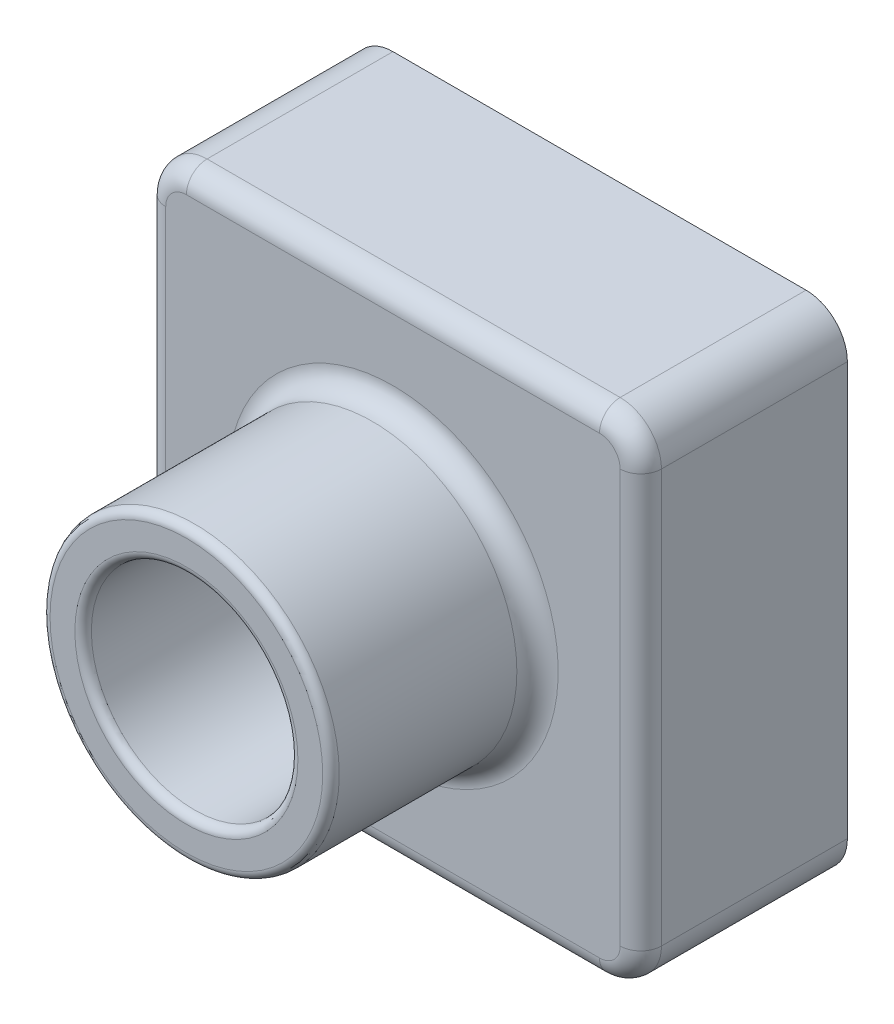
ISO-10303-21;
HEADER;
FILE_DESCRIPTION(('STEP AP214'),'2;1');
FILE_NAME('part.step','',(''),(''),'','','');
FILE_SCHEMA(('AUTOMOTIVE_DESIGN { 1 0 10303 214 1 1 1 1 }'));
ENDSEC;
DATA;
#1=APPLICATION_CONTEXT('core data for automotive mechanical design processes');
#2=APPLICATION_PROTOCOL_DEFINITION('international standard','automotive_design',2000,#1);
#3=PRODUCT_CONTEXT('',#1,'mechanical');
#4=PRODUCT('Part','Part','',(#3));
#5=PRODUCT_RELATED_PRODUCT_CATEGORY('part','',(#4));
#6=PRODUCT_DEFINITION_FORMATION('','',#4);
#7=PRODUCT_DEFINITION_CONTEXT('part definition',#1,'design');
#8=PRODUCT_DEFINITION('design','',#6,#7);
#9=PRODUCT_DEFINITION_SHAPE('','',#8);
#10=(LENGTH_UNIT() NAMED_UNIT(*) SI_UNIT(.MILLI.,.METRE.));
#11=(NAMED_UNIT(*) PLANE_ANGLE_UNIT() SI_UNIT($,.RADIAN.));
#12=(NAMED_UNIT(*) SI_UNIT($,.STERADIAN.) SOLID_ANGLE_UNIT());
#13=UNCERTAINTY_MEASURE_WITH_UNIT(LENGTH_MEASURE(1.E-05),#10,'distance_accuracy_value','');
#14=(GEOMETRIC_REPRESENTATION_CONTEXT(3) GLOBAL_UNCERTAINTY_ASSIGNED_CONTEXT((#13)) GLOBAL_UNIT_ASSIGNED_CONTEXT((#10,
#11,#12)) REPRESENTATION_CONTEXT('',''));
#15=CARTESIAN_POINT('',(0.,0.,0.));
#16=DIRECTION('',(0.,0.,1.));
#17=DIRECTION('',(1.,0.,0.));
#18=AXIS2_PLACEMENT_3D('',#15,#16,#17);
#19=CARTESIAN_POINT('',(0.,120.,0.));
#20=DIRECTION('',(0.,0.,-1.));
#21=DIRECTION('',(-1.,0.,0.));
#22=AXIS2_PLACEMENT_3D('',#19,#20,#21);
#23=PLANE('',#22);
#24=DIRECTION('',(0.,-1.,0.));
#25=VECTOR('',#24,1.);
#26=CARTESIAN_POINT('',(0.,0.,0.));
#27=LINE('',#26,#25);
#28=CARTESIAN_POINT('',(0.,110.,0.));
#29=VERTEX_POINT('',#28);
#30=CARTESIAN_POINT('',(0.,10.,0.));
#31=VERTEX_POINT('',#30);
#32=EDGE_CURVE('E324',#29,#31,#27,.T.);
#33=ORIENTED_EDGE('',*,*,#32,.F.);
#34=CARTESIAN_POINT('',(9.99999999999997,110.,0.));
#35=DIRECTION('',(0.,0.,-1.));
#36=DIRECTION('',(-1.,0.,0.));
#37=AXIS2_PLACEMENT_3D('',#34,#35,#36);
#38=CIRCLE('',#37,10.);
#39=CARTESIAN_POINT('',(9.99999999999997,120.,0.));
#40=VERTEX_POINT('',#39);
#41=EDGE_CURVE('E348',#29,#40,#38,.T.);
#42=ORIENTED_EDGE('',*,*,#41,.T.);
#43=DIRECTION('',(-1.,0.,0.));
#44=VECTOR('',#43,1.);
#45=CARTESIAN_POINT('',(0.,120.,0.));
#46=LINE('',#45,#44);
#47=CARTESIAN_POINT('',(110.,120.,0.));
#48=VERTEX_POINT('',#47);
#49=EDGE_CURVE('E334',#48,#40,#46,.T.);
#50=ORIENTED_EDGE('',*,*,#49,.F.);
#51=CARTESIAN_POINT('',(110.,110.,0.));
#52=DIRECTION('',(0.,0.,-1.));
#53=DIRECTION('',(-1.,0.,0.));
#54=AXIS2_PLACEMENT_3D('',#51,#52,#53);
#55=CIRCLE('',#54,10.);
#56=CARTESIAN_POINT('',(120.,110.,0.));
#57=VERTEX_POINT('',#56);
#58=EDGE_CURVE('E346',#48,#57,#55,.T.);
#59=ORIENTED_EDGE('',*,*,#58,.T.);
#60=DIRECTION('',(0.,1.,0.));
#61=VECTOR('',#60,1.);
#62=CARTESIAN_POINT('',(120.,0.,0.));
#63=LINE('',#62,#61);
#64=CARTESIAN_POINT('',(120.,10.,0.));
#65=VERTEX_POINT('',#64);
#66=EDGE_CURVE('E331',#65,#57,#63,.T.);
#67=ORIENTED_EDGE('',*,*,#66,.F.);
#68=CARTESIAN_POINT('',(110.,10.,0.));
#69=DIRECTION('',(0.,0.,-1.));
#70=DIRECTION('',(-1.,0.,0.));
#71=AXIS2_PLACEMENT_3D('',#68,#69,#70);
#72=CIRCLE('',#71,10.);
#73=CARTESIAN_POINT('',(110.,0.,0.));
#74=VERTEX_POINT('',#73);
#75=EDGE_CURVE('E344',#65,#74,#72,.T.);
#76=ORIENTED_EDGE('',*,*,#75,.T.);
#77=DIRECTION('',(1.,0.,0.));
#78=VECTOR('',#77,1.);
#79=CARTESIAN_POINT('',(0.,0.,0.));
#80=LINE('',#79,#78);
#81=CARTESIAN_POINT('',(9.99999999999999,0.,0.));
#82=VERTEX_POINT('',#81);
#83=EDGE_CURVE('E328',#82,#74,#80,.T.);
#84=ORIENTED_EDGE('',*,*,#83,.F.);
#85=CARTESIAN_POINT('',(9.99999999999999,10.,0.));
#86=DIRECTION('',(0.,0.,-1.));
#87=DIRECTION('',(-1.,0.,0.));
#88=AXIS2_PLACEMENT_3D('',#85,#86,#87);
#89=CIRCLE('',#88,10.);
#90=EDGE_CURVE('E342',#82,#31,#89,.T.);
#91=ORIENTED_EDGE('',*,*,#90,.T.);
#92=EDGE_LOOP('',(#33,#42,#50,#59,#67,#76,#84,#91));
#93=FACE_BOUND('',#92,.T.);
#94=CARTESIAN_POINT('',(9.99999999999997,110.,0.));
#95=DIRECTION('',(0.,0.,-1.));
#96=DIRECTION('',(-1.,0.,0.));
#97=AXIS2_PLACEMENT_3D('',#94,#95,#96);
#98=CIRCLE('',#97,8.);
#99=CARTESIAN_POINT('',(1.99999999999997,110.,0.));
#100=VERTEX_POINT('',#99);
#101=CARTESIAN_POINT('',(9.99999999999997,118.,0.));
#102=VERTEX_POINT('',#101);
#103=EDGE_CURVE('E281',#100,#102,#98,.T.);
#104=ORIENTED_EDGE('',*,*,#103,.F.);
#105=DIRECTION('',(0.,-1.,0.));
#106=VECTOR('',#105,1.);
#107=CARTESIAN_POINT('',(1.99999999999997,120.,0.));
#108=LINE('',#107,#106);
#109=CARTESIAN_POINT('',(2.,10.,0.));
#110=VERTEX_POINT('',#109);
#111=EDGE_CURVE('E306',#100,#110,#108,.T.);
#112=ORIENTED_EDGE('',*,*,#111,.T.);
#113=CARTESIAN_POINT('',(9.99999999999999,10.,0.));
#114=DIRECTION('',(0.,0.,-1.));
#115=DIRECTION('',(-1.,0.,0.));
#116=AXIS2_PLACEMENT_3D('',#113,#114,#115);
#117=CIRCLE('',#116,8.);
#118=CARTESIAN_POINT('',(9.99999999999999,2.,0.));
#119=VERTEX_POINT('',#118);
#120=EDGE_CURVE('E272',#119,#110,#117,.T.);
#121=ORIENTED_EDGE('',*,*,#120,.F.);
#122=DIRECTION('',(1.,0.,0.));
#123=VECTOR('',#122,1.);
#124=CARTESIAN_POINT('',(0.,2.,0.));
#125=LINE('',#124,#123);
#126=CARTESIAN_POINT('',(110.,2.,0.));
#127=VERTEX_POINT('',#126);
#128=EDGE_CURVE('E47',#119,#127,#125,.T.);
#129=ORIENTED_EDGE('',*,*,#128,.T.);
#130=CARTESIAN_POINT('',(110.,10.,0.));
#131=DIRECTION('',(0.,0.,-1.));
#132=DIRECTION('',(-1.,0.,0.));
#133=AXIS2_PLACEMENT_3D('',#130,#131,#132);
#134=CIRCLE('',#133,8.);
#135=CARTESIAN_POINT('',(118.,10.,0.));
#136=VERTEX_POINT('',#135);
#137=EDGE_CURVE('E315',#136,#127,#134,.T.);
#138=ORIENTED_EDGE('',*,*,#137,.F.);
#139=DIRECTION('',(0.,1.,0.));
#140=VECTOR('',#139,1.);
#141=CARTESIAN_POINT('',(118.,120.,0.));
#142=LINE('',#141,#140);
#143=CARTESIAN_POINT('',(118.,110.,0.));
#144=VERTEX_POINT('',#143);
#145=EDGE_CURVE('E313',#136,#144,#142,.T.);
#146=ORIENTED_EDGE('',*,*,#145,.T.);
#147=CARTESIAN_POINT('',(110.,110.,0.));
#148=DIRECTION('',(0.,0.,-1.));
#149=DIRECTION('',(-1.,0.,0.));
#150=AXIS2_PLACEMENT_3D('',#147,#148,#149);
#151=CIRCLE('',#150,8.);
#152=CARTESIAN_POINT('',(110.,118.,0.));
#153=VERTEX_POINT('',#152);
#154=EDGE_CURVE('E310',#153,#144,#151,.T.);
#155=ORIENTED_EDGE('',*,*,#154,.F.);
#156=DIRECTION('',(-1.,0.,0.));
#157=VECTOR('',#156,1.);
#158=CARTESIAN_POINT('',(0.,118.,0.));
#159=LINE('',#158,#157);
#160=EDGE_CURVE('E268',#153,#102,#159,.T.);
#161=ORIENTED_EDGE('',*,*,#160,.T.);
#162=EDGE_LOOP('',(#104,#112,#121,#129,#138,#146,#155,#161));
#163=FACE_BOUND('',#162,.T.);
#164=ADVANCED_FACE('F32',(#93,#163),#23,.T.);
#165=CARTESIAN_POINT('',(0.,120.,50.));
#166=DIRECTION('',(0.,0.,-1.));
#167=DIRECTION('',(-1.,0.,0.));
#168=AXIS2_PLACEMENT_3D('',#165,#166,#167);
#169=PLANE('',#168);
#170=CARTESIAN_POINT('',(60.,60.,50.));
#171=DIRECTION('',(0.,0.,-1.));
#172=DIRECTION('',(-1.,0.,0.));
#173=AXIS2_PLACEMENT_3D('',#170,#171,#172);
#174=CIRCLE('',#173,40.);
#175=CARTESIAN_POINT('',(20.,60.,50.));
#176=VERTEX_POINT('',#175);
#177=EDGE_CURVE('E384',#176,#176,#174,.T.);
#178=ORIENTED_EDGE('',*,*,#177,.T.);
#179=EDGE_LOOP('',(#178));
#180=FACE_BOUND('',#179,.T.);
#181=DIRECTION('',(0.,1.,0.));
#182=VECTOR('',#181,1.);
#183=CARTESIAN_POINT('',(115.,120.,50.));
#184=LINE('',#183,#182);
#185=CARTESIAN_POINT('',(115.,10.,50.));
#186=VERTEX_POINT('',#185);
#187=CARTESIAN_POINT('',(115.,110.,50.));
#188=VERTEX_POINT('',#187);
#189=EDGE_CURVE('E379',#186,#188,#184,.T.);
#190=ORIENTED_EDGE('',*,*,#189,.T.);
#191=CARTESIAN_POINT('',(110.,110.,50.));
#192=DIRECTION('',(0.,0.,-1.));
#193=DIRECTION('',(-1.,0.,0.));
#194=AXIS2_PLACEMENT_3D('',#191,#192,#193);
#195=CIRCLE('',#194,5.);
#196=CARTESIAN_POINT('',(110.,115.,50.));
#197=VERTEX_POINT('',#196);
#198=EDGE_CURVE('E381',#188,#197,#195,.F.);
#199=ORIENTED_EDGE('',*,*,#198,.T.);
#200=DIRECTION('',(-1.,0.,0.));
#201=VECTOR('',#200,1.);
#202=CARTESIAN_POINT('',(0.,115.,50.));
#203=LINE('',#202,#201);
#204=CARTESIAN_POINT('',(9.99999999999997,115.,50.));
#205=VERTEX_POINT('',#204);
#206=EDGE_CURVE('E367',#197,#205,#203,.T.);
#207=ORIENTED_EDGE('',*,*,#206,.T.);
#208=CARTESIAN_POINT('',(9.99999999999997,110.,50.));
#209=DIRECTION('',(0.,0.,-1.));
#210=DIRECTION('',(-1.,0.,0.));
#211=AXIS2_PLACEMENT_3D('',#208,#209,#210);
#212=CIRCLE('',#211,5.);
#213=CARTESIAN_POINT('',(4.99999999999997,110.,50.));
#214=VERTEX_POINT('',#213);
#215=EDGE_CURVE('E369',#205,#214,#212,.F.);
#216=ORIENTED_EDGE('',*,*,#215,.T.);
#217=DIRECTION('',(0.,-1.,0.));
#218=VECTOR('',#217,1.);
#219=CARTESIAN_POINT('',(4.99999999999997,120.,50.));
#220=LINE('',#219,#218);
#221=CARTESIAN_POINT('',(5.,10.,50.));
#222=VERTEX_POINT('',#221);
#223=EDGE_CURVE('E371',#214,#222,#220,.T.);
#224=ORIENTED_EDGE('',*,*,#223,.T.);
#225=CARTESIAN_POINT('',(9.99999999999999,10.,50.));
#226=DIRECTION('',(0.,0.,-1.));
#227=DIRECTION('',(-1.,0.,0.));
#228=AXIS2_PLACEMENT_3D('',#225,#226,#227);
#229=CIRCLE('',#228,5.);
#230=CARTESIAN_POINT('',(9.99999999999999,5.,50.));
#231=VERTEX_POINT('',#230);
#232=EDGE_CURVE('E373',#222,#231,#229,.F.);
#233=ORIENTED_EDGE('',*,*,#232,.T.);
#234=DIRECTION('',(1.,0.,0.));
#235=VECTOR('',#234,1.);
#236=CARTESIAN_POINT('',(0.,5.,50.));
#237=LINE('',#236,#235);
#238=CARTESIAN_POINT('',(110.,5.,50.));
#239=VERTEX_POINT('',#238);
#240=EDGE_CURVE('E375',#231,#239,#237,.T.);
#241=ORIENTED_EDGE('',*,*,#240,.T.);
#242=CARTESIAN_POINT('',(110.,10.,50.));
#243=DIRECTION('',(0.,0.,-1.));
#244=DIRECTION('',(-1.,0.,0.));
#245=AXIS2_PLACEMENT_3D('',#242,#243,#244);
#246=CIRCLE('',#245,5.);
#247=EDGE_CURVE('E377',#239,#186,#246,.F.);
#248=ORIENTED_EDGE('',*,*,#247,.T.);
#249=EDGE_LOOP('',(#190,#199,#207,#216,#224,#233,#241,#248));
#250=FACE_BOUND('',#249,.T.);
#251=ADVANCED_FACE('F473',(#180,#250),#169,.F.);
#252=CARTESIAN_POINT('',(0.,0.,50.));
#253=DIRECTION('',(1.,0.,0.));
#254=DIRECTION('',(0.,1.,0.));
#255=AXIS2_PLACEMENT_3D('',#252,#253,#254);
#256=PLANE('',#255);
#257=DIRECTION('',(0.,0.,-1.));
#258=VECTOR('',#257,1.);
#259=CARTESIAN_POINT('',(0.,10.,50.));
#260=LINE('',#259,#258);
#261=CARTESIAN_POINT('',(0.,10.,45.));
#262=VERTEX_POINT('',#261);
#263=EDGE_CURVE('E337',#31,#262,#260,.F.);
#264=ORIENTED_EDGE('',*,*,#263,.T.);
#265=DIRECTION('',(0.,-1.,0.));
#266=VECTOR('',#265,1.);
#267=CARTESIAN_POINT('',(0.,0.,45.));
#268=LINE('',#267,#266);
#269=CARTESIAN_POINT('',(0.,110.,45.));
#270=VERTEX_POINT('',#269);
#271=EDGE_CURVE('E398',#262,#270,#268,.F.);
#272=ORIENTED_EDGE('',*,*,#271,.T.);
#273=DIRECTION('',(0.,0.,-1.));
#274=VECTOR('',#273,1.);
#275=CARTESIAN_POINT('',(0.,110.,50.));
#276=LINE('',#275,#274);
#277=EDGE_CURVE('E340',#270,#29,#276,.T.);
#278=ORIENTED_EDGE('',*,*,#277,.T.);
#279=ORIENTED_EDGE('',*,*,#32,.T.);
#280=EDGE_LOOP('',(#264,#272,#278,#279));
#281=FACE_BOUND('',#280,.T.);
#282=ADVANCED_FACE('F478',(#281),#256,.F.);
#283=CARTESIAN_POINT('',(0.,0.,50.));
#284=DIRECTION('',(0.,1.,0.));
#285=DIRECTION('',(0.,0.,1.));
#286=AXIS2_PLACEMENT_3D('',#283,#284,#285);
#287=PLANE('',#286);
#288=DIRECTION('',(0.,0.,-1.));
#289=VECTOR('',#288,1.);
#290=CARTESIAN_POINT('',(110.,0.,50.));
#291=LINE('',#290,#289);
#292=CARTESIAN_POINT('',(110.,0.,45.));
#293=VERTEX_POINT('',#292);
#294=EDGE_CURVE('E361',#74,#293,#291,.F.);
#295=ORIENTED_EDGE('',*,*,#294,.T.);
#296=DIRECTION('',(1.,0.,0.));
#297=VECTOR('',#296,1.);
#298=CARTESIAN_POINT('',(0.,0.,45.));
#299=LINE('',#298,#297);
#300=CARTESIAN_POINT('',(9.99999999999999,0.,45.));
#301=VERTEX_POINT('',#300);
#302=EDGE_CURVE('E394',#293,#301,#299,.F.);
#303=ORIENTED_EDGE('',*,*,#302,.T.);
#304=DIRECTION('',(0.,0.,-1.));
#305=VECTOR('',#304,1.);
#306=CARTESIAN_POINT('',(9.99999999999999,0.,50.));
#307=LINE('',#306,#305);
#308=EDGE_CURVE('E359',#301,#82,#307,.T.);
#309=ORIENTED_EDGE('',*,*,#308,.T.);
#310=ORIENTED_EDGE('',*,*,#83,.T.);
#311=EDGE_LOOP('',(#295,#303,#309,#310));
#312=FACE_BOUND('',#311,.T.);
#313=ADVANCED_FACE('F882',(#312),#287,.F.);
#314=CARTESIAN_POINT('',(120.,0.,50.));
#315=DIRECTION('',(-1.,0.,0.));
#316=DIRECTION('',(0.,-1.,0.));
#317=AXIS2_PLACEMENT_3D('',#314,#315,#316);
#318=PLANE('',#317);
#319=DIRECTION('',(0.,0.,-1.));
#320=VECTOR('',#319,1.);
#321=CARTESIAN_POINT('',(120.,110.,50.));
#322=LINE('',#321,#320);
#323=CARTESIAN_POINT('',(120.,110.,45.));
#324=VERTEX_POINT('',#323);
#325=EDGE_CURVE('E356',#57,#324,#322,.F.);
#326=ORIENTED_EDGE('',*,*,#325,.T.);
#327=DIRECTION('',(0.,1.,0.));
#328=VECTOR('',#327,1.);
#329=CARTESIAN_POINT('',(120.,0.,45.));
#330=LINE('',#329,#328);
#331=CARTESIAN_POINT('',(120.,10.,45.));
#332=VERTEX_POINT('',#331);
#333=EDGE_CURVE('E390',#324,#332,#330,.F.);
#334=ORIENTED_EDGE('',*,*,#333,.T.);
#335=DIRECTION('',(0.,0.,-1.));
#336=VECTOR('',#335,1.);
#337=CARTESIAN_POINT('',(120.,10.,50.));
#338=LINE('',#337,#336);
#339=EDGE_CURVE('E354',#332,#65,#338,.T.);
#340=ORIENTED_EDGE('',*,*,#339,.T.);
#341=ORIENTED_EDGE('',*,*,#66,.T.);
#342=EDGE_LOOP('',(#326,#334,#340,#341));
#343=FACE_BOUND('',#342,.T.);
#344=ADVANCED_FACE('F467',(#343),#318,.F.);
#345=CARTESIAN_POINT('',(0.,120.,50.));
#346=DIRECTION('',(0.,-1.,0.));
#347=DIRECTION('',(0.,0.,-1.));
#348=AXIS2_PLACEMENT_3D('',#345,#346,#347);
#349=PLANE('',#348);
#350=DIRECTION('',(0.,0.,-1.));
#351=VECTOR('',#350,1.);
#352=CARTESIAN_POINT('',(9.99999999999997,120.,50.));
#353=LINE('',#352,#351);
#354=CARTESIAN_POINT('',(9.99999999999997,120.,45.));
#355=VERTEX_POINT('',#354);
#356=EDGE_CURVE('E352',#40,#355,#353,.F.);
#357=ORIENTED_EDGE('',*,*,#356,.T.);
#358=DIRECTION('',(-1.,0.,0.));
#359=VECTOR('',#358,1.);
#360=CARTESIAN_POINT('',(0.,120.,45.));
#361=LINE('',#360,#359);
#362=CARTESIAN_POINT('',(110.,120.,45.));
#363=VERTEX_POINT('',#362);
#364=EDGE_CURVE('E401',#355,#363,#361,.F.);
#365=ORIENTED_EDGE('',*,*,#364,.T.);
#366=DIRECTION('',(0.,0.,-1.));
#367=VECTOR('',#366,1.);
#368=CARTESIAN_POINT('',(110.,120.,50.));
#369=LINE('',#368,#367);
#370=EDGE_CURVE('E350',#363,#48,#369,.T.);
#371=ORIENTED_EDGE('',*,*,#370,.T.);
#372=ORIENTED_EDGE('',*,*,#49,.T.);
#373=EDGE_LOOP('',(#357,#365,#371,#372));
#374=FACE_BOUND('',#373,.T.);
#375=ADVANCED_FACE('F459',(#374),#349,.F.);
#376=CARTESIAN_POINT('',(60.,60.,0.));
#377=DIRECTION('',(0.,0.,-1.));
#378=DIRECTION('',(-1.,0.,0.));
#379=AXIS2_PLACEMENT_3D('',#376,#377,#378);
#380=CIRCLE('',#379,27.);
#381=CARTESIAN_POINT('',(87.,60.,0.));
#382=VERTEX_POINT('',#381);
#383=EDGE_CURVE('E263',#382,#382,#380,.F.);
#384=ORIENTED_EDGE('',*,*,#383,.F.);
#385=EDGE_LOOP('',(#384));
#386=FACE_BOUND('',#385,.T.);
#387=CARTESIAN_POINT('',(60.,60.,0.));
#388=DIRECTION('',(0.,0.,1.));
#389=DIRECTION('',(1.,0.,0.));
#390=AXIS2_PLACEMENT_3D('',#387,#388,#389);
#391=CIRCLE('',#390,25.);
#392=CARTESIAN_POINT('',(85.,60.,0.));
#393=VERTEX_POINT('',#392);
#394=EDGE_CURVE('E321',#393,#393,#391,.T.);
#395=ORIENTED_EDGE('',*,*,#394,.T.);
#396=EDGE_LOOP('',(#395));
#397=FACE_BOUND('',#396,.T.);
#398=ADVANCED_FACE('F457',(#386,#397),#23,.T.);
#399=CARTESIAN_POINT('',(60.,60.,100.));
#400=DIRECTION('',(0.,0.,-1.));
#401=DIRECTION('',(-1.,0.,0.));
#402=AXIS2_PLACEMENT_3D('',#399,#400,#401);
#403=CYLINDRICAL_SURFACE('',#402,35.);
#404=CARTESIAN_POINT('',(60.,60.,98.));
#405=DIRECTION('',(0.,0.,1.));
#406=DIRECTION('',(1.,0.,0.));
#407=AXIS2_PLACEMENT_3D('',#404,#405,#406);
#408=CIRCLE('',#407,35.);
#409=CARTESIAN_POINT('',(25.,60.,98.));
#410=VERTEX_POINT('',#409);
#411=EDGE_CURVE('E40',#410,#410,#408,.F.);
#412=CARTESIAN_POINT('',(60.,60.,55.));
#413=DIRECTION('',(0.,0.,-1.));
#414=DIRECTION('',(-1.,0.,0.));
#415=AXIS2_PLACEMENT_3D('',#412,#413,#414);
#416=CIRCLE('',#415,35.);
#417=CARTESIAN_POINT('',(25.,60.,55.));
#418=VERTEX_POINT('',#417);
#419=EDGE_CURVE('E364',#418,#418,#416,.F.);
#420=CARTESIAN_POINT('',(25.,60.,98.));
#421=CARTESIAN_POINT('',(25.,60.,97.5520833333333));
#422=CARTESIAN_POINT('',(25.,60.,97.1041666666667));
#423=CARTESIAN_POINT('',(25.,60.,96.2083333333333));
#424=CARTESIAN_POINT('',(25.,60.,95.7604166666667));
#425=CARTESIAN_POINT('',(25.,60.,94.8645833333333));
#426=CARTESIAN_POINT('',(25.,60.,94.4166666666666));
#427=CARTESIAN_POINT('',(25.,60.,93.5208333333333));
#428=CARTESIAN_POINT('',(25.,60.,93.0729166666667));
#429=CARTESIAN_POINT('',(25.,60.,92.1770833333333));
#430=CARTESIAN_POINT('',(25.,60.,91.7291666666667));
#431=CARTESIAN_POINT('',(25.,60.,90.8333333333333));
#432=CARTESIAN_POINT('',(25.,60.,90.3854166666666));
#433=CARTESIAN_POINT('',(25.,60.,89.4895833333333));
#434=CARTESIAN_POINT('',(25.,60.,89.0416666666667));
#435=CARTESIAN_POINT('',(25.,60.,88.1458333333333));
#436=CARTESIAN_POINT('',(25.,60.,87.6979166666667));
#437=CARTESIAN_POINT('',(25.,60.,86.8020833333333));
#438=CARTESIAN_POINT('',(25.,60.,86.3541666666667));
#439=CARTESIAN_POINT('',(25.,60.,85.4583333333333));
#440=CARTESIAN_POINT('',(25.,60.,85.0104166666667));
#441=CARTESIAN_POINT('',(25.,60.,84.1145833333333));
#442=CARTESIAN_POINT('',(25.,60.,83.6666666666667));
#443=CARTESIAN_POINT('',(25.,60.,82.7708333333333));
#444=CARTESIAN_POINT('',(25.,60.,82.3229166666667));
#445=CARTESIAN_POINT('',(25.,60.,81.4270833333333));
#446=CARTESIAN_POINT('',(25.,60.,80.9791666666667));
#447=CARTESIAN_POINT('',(25.,60.,80.0833333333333));
#448=CARTESIAN_POINT('',(25.,60.,79.6354166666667));
#449=CARTESIAN_POINT('',(25.,60.,78.7395833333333));
#450=CARTESIAN_POINT('',(25.,60.,78.2916666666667));
#451=CARTESIAN_POINT('',(25.,60.,77.3958333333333));
#452=CARTESIAN_POINT('',(25.,60.,76.9479166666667));
#453=CARTESIAN_POINT('',(25.,60.,76.0520833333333));
#454=CARTESIAN_POINT('',(25.,60.,75.6041666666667));
#455=CARTESIAN_POINT('',(25.,60.,74.7083333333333));
#456=CARTESIAN_POINT('',(25.,60.,74.2604166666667));
#457=CARTESIAN_POINT('',(25.,60.,73.3645833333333));
#458=CARTESIAN_POINT('',(25.,60.,72.9166666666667));
#459=CARTESIAN_POINT('',(25.,60.,72.0208333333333));
#460=CARTESIAN_POINT('',(25.,60.,71.5729166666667));
#461=CARTESIAN_POINT('',(25.,60.,70.6770833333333));
#462=CARTESIAN_POINT('',(25.,60.,70.2291666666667));
#463=CARTESIAN_POINT('',(25.,60.,69.3333333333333));
#464=CARTESIAN_POINT('',(25.,60.,68.8854166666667));
#465=CARTESIAN_POINT('',(25.,60.,67.9895833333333));
#466=CARTESIAN_POINT('',(25.,60.,67.5416666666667));
#467=CARTESIAN_POINT('',(25.,60.,66.6458333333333));
#468=CARTESIAN_POINT('',(25.,60.,66.1979166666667));
#469=CARTESIAN_POINT('',(25.,60.,65.3020833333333));
#470=CARTESIAN_POINT('',(25.,60.,64.8541666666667));
#471=CARTESIAN_POINT('',(25.,60.,63.9583333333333));
#472=CARTESIAN_POINT('',(25.,60.,63.5104166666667));
#473=CARTESIAN_POINT('',(25.,60.,62.6145833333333));
#474=CARTESIAN_POINT('',(25.,60.,62.1666666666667));
#475=CARTESIAN_POINT('',(25.,60.,61.2708333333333));
#476=CARTESIAN_POINT('',(25.,60.,60.8229166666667));
#477=CARTESIAN_POINT('',(25.,60.,59.9270833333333));
#478=CARTESIAN_POINT('',(25.,60.,59.4791666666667));
#479=CARTESIAN_POINT('',(25.,60.,58.5833333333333));
#480=CARTESIAN_POINT('',(25.,60.,58.1354166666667));
#481=CARTESIAN_POINT('',(25.,60.,57.2395833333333));
#482=CARTESIAN_POINT('',(25.,60.,56.7916666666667));
#483=CARTESIAN_POINT('',(25.,60.,55.8958333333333));
#484=CARTESIAN_POINT('',(25.,60.,55.4479166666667));
#485=CARTESIAN_POINT('',(25.,60.,55.));
#486=B_SPLINE_CURVE_WITH_KNOTS('',3,(#420,#421,#422,#423,#424,#425,#426,#427,#428,#429,#430,
#431,#432,#433,#434,#435,#436,#437,#438,#439,#440,#441,#442,#443,#444,#445,#446,#447,#448,#449,
#450,#451,#452,#453,#454,#455,#456,#457,#458,#459,#460,#461,#462,#463,#464,#465,#466,#467,#468,
#469,#470,#471,#472,#473,#474,#475,#476,#477,#478,#479,#480,#481,#482,#483,#484,#485),
.UNSPECIFIED.,.F.,.F.,(4,2,2,2,2,2,2,2,2,2,2,2,2,2,2,2,2,2,2,2,2,2,2,2,2,2,2,2,2,2,2,2,4),(0.,
1.34375,2.68750000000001,4.03125,5.375,6.71875000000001,8.0625,9.40625000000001,10.75,12.09375,
13.4375,14.78125,16.125,17.46875,18.8125,20.15625,21.5,22.84375,24.1875,25.53125,26.875,
28.21875,29.5625,30.90625,32.25,33.59375,34.9375,36.28125,37.625,38.96875,40.3125,41.65625,43.),.UNSPECIFIED.);
#487=EDGE_CURVE('BSEAM431',#410,#418,#486,.T.);
#488=ORIENTED_EDGE('',*,*,#411,.T.);
#489=ORIENTED_EDGE('',*,*,#419,.T.);
#490=ORIENTED_EDGE('',*,*,#487,.T.);
#491=ORIENTED_EDGE('',*,*,#487,.F.);
#492=EDGE_LOOP('',(#488,#490,#489,#491));
#493=FACE_BOUND('',#492,.T.);
#494=ADVANCED_FACE('F431',(#493),#403,.T.);
#495=CARTESIAN_POINT('',(60.,60.,100.));
#496=DIRECTION('',(0.,0.,1.));
#497=DIRECTION('',(1.,0.,0.));
#498=AXIS2_PLACEMENT_3D('',#495,#496,#497);
#499=PLANE('',#498);
#500=CARTESIAN_POINT('',(60.,60.,100.));
#501=DIRECTION('',(0.,0.,1.));
#502=DIRECTION('',(1.,0.,0.));
#503=AXIS2_PLACEMENT_3D('',#500,#501,#502);
#504=CIRCLE('',#503,33.);
#505=CARTESIAN_POINT('',(93.,60.,100.));
#506=VERTEX_POINT('',#505);
#507=EDGE_CURVE('E426',#506,#506,#504,.T.);
#508=ORIENTED_EDGE('',*,*,#507,.T.);
#509=EDGE_LOOP('',(#508));
#510=FACE_BOUND('',#509,.T.);
#511=CARTESIAN_POINT('',(60.,60.,100.));
#512=DIRECTION('',(0.,0.,1.));
#513=DIRECTION('',(1.,0.,0.));
#514=AXIS2_PLACEMENT_3D('',#511,#512,#513);
#515=CIRCLE('',#514,27.);
#516=CARTESIAN_POINT('',(87.,60.,100.));
#517=VERTEX_POINT('',#516);
#518=EDGE_CURVE('E403',#517,#517,#515,.F.);
#519=ORIENTED_EDGE('',*,*,#518,.T.);
#520=EDGE_LOOP('',(#519));
#521=FACE_BOUND('',#520,.T.);
#522=ADVANCED_FACE('F440',(#510,#521),#499,.T.);
#523=CARTESIAN_POINT('',(60.,60.,0.));
#524=DIRECTION('',(0.,0.,1.));
#525=DIRECTION('',(1.,0.,0.));
#526=AXIS2_PLACEMENT_3D('',#523,#524,#525);
#527=CYLINDRICAL_SURFACE('',#526,25.);
#528=CARTESIAN_POINT('',(60.,60.,98.));
#529=DIRECTION('',(0.,0.,1.));
#530=DIRECTION('',(1.,0.,0.));
#531=AXIS2_PLACEMENT_3D('',#528,#529,#530);
#532=CIRCLE('',#531,25.);
#533=CARTESIAN_POINT('',(85.,60.,98.));
#534=VERTEX_POINT('',#533);
#535=EDGE_CURVE('E11',#534,#534,#532,.T.);
#536=CARTESIAN_POINT('',(85.,60.,98.));
#537=CARTESIAN_POINT('',(85.,60.,96.9791666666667));
#538=CARTESIAN_POINT('',(85.,60.,95.9583333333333));
#539=CARTESIAN_POINT('',(85.,60.,93.9166666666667));
#540=CARTESIAN_POINT('',(85.,60.,92.8958333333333));
#541=CARTESIAN_POINT('',(85.,60.,90.8541666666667));
#542=CARTESIAN_POINT('',(85.,60.,89.8333333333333));
#543=CARTESIAN_POINT('',(85.,60.,87.7916666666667));
#544=CARTESIAN_POINT('',(85.,60.,86.7708333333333));
#545=CARTESIAN_POINT('',(85.,60.,84.7291666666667));
#546=CARTESIAN_POINT('',(85.,60.,83.7083333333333));
#547=CARTESIAN_POINT('',(85.,60.,81.6666666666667));
#548=CARTESIAN_POINT('',(85.,60.,80.6458333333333));
#549=CARTESIAN_POINT('',(85.,60.,78.6041666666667));
#550=CARTESIAN_POINT('',(85.,60.,77.5833333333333));
#551=CARTESIAN_POINT('',(85.,60.,75.5416666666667));
#552=CARTESIAN_POINT('',(85.,60.,74.5208333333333));
#553=CARTESIAN_POINT('',(85.,60.,72.4791666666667));
#554=CARTESIAN_POINT('',(85.,60.,71.4583333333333));
#555=CARTESIAN_POINT('',(85.,60.,69.4166666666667));
#556=CARTESIAN_POINT('',(85.,60.,68.3958333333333));
#557=CARTESIAN_POINT('',(85.,60.,66.3541666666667));
#558=CARTESIAN_POINT('',(85.,60.,65.3333333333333));
#559=CARTESIAN_POINT('',(85.,60.,63.2916666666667));
#560=CARTESIAN_POINT('',(85.,60.,62.2708333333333));
#561=CARTESIAN_POINT('',(85.,60.,60.2291666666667));
#562=CARTESIAN_POINT('',(85.,60.,59.2083333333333));
#563=CARTESIAN_POINT('',(85.,60.,57.1666666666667));
#564=CARTESIAN_POINT('',(85.,60.,56.1458333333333));
#565=CARTESIAN_POINT('',(85.,60.,54.1041666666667));
#566=CARTESIAN_POINT('',(85.,60.,53.0833333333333));
#567=CARTESIAN_POINT('',(85.,60.,51.0416666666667));
#568=CARTESIAN_POINT('',(85.,60.,50.0208333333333));
#569=CARTESIAN_POINT('',(85.,60.,47.9791666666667));
#570=CARTESIAN_POINT('',(85.,60.,46.9583333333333));
#571=CARTESIAN_POINT('',(85.,60.,44.9166666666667));
#572=CARTESIAN_POINT('',(85.,60.,43.8958333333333));
#573=CARTESIAN_POINT('',(85.,60.,41.8541666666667));
#574=CARTESIAN_POINT('',(85.,60.,40.8333333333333));
#575=CARTESIAN_POINT('',(85.,60.,38.7916666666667));
#576=CARTESIAN_POINT('',(85.,60.,37.7708333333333));
#577=CARTESIAN_POINT('',(85.,60.,35.7291666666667));
#578=CARTESIAN_POINT('',(85.,60.,34.7083333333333));
#579=CARTESIAN_POINT('',(85.,60.,32.6666666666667));
#580=CARTESIAN_POINT('',(85.,60.,31.6458333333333));
#581=CARTESIAN_POINT('',(85.,60.,29.6041666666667));
#582=CARTESIAN_POINT('',(85.,60.,28.5833333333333));
#583=CARTESIAN_POINT('',(85.,60.,26.5416666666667));
#584=CARTESIAN_POINT('',(85.,60.,25.5208333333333));
#585=CARTESIAN_POINT('',(85.,60.,23.4791666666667));
#586=CARTESIAN_POINT('',(85.,60.,22.4583333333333));
#587=CARTESIAN_POINT('',(85.,60.,20.4166666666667));
#588=CARTESIAN_POINT('',(85.,60.,19.3958333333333));
#589=CARTESIAN_POINT('',(85.,60.,17.3541666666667));
#590=CARTESIAN_POINT('',(85.,60.,16.3333333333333));
#591=CARTESIAN_POINT('',(85.,60.,14.2916666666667));
#592=CARTESIAN_POINT('',(85.,60.,13.2708333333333));
#593=CARTESIAN_POINT('',(85.,60.,11.2291666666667));
#594=CARTESIAN_POINT('',(85.,60.,10.2083333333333));
#595=CARTESIAN_POINT('',(85.,60.,8.16666666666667));
#596=CARTESIAN_POINT('',(85.,60.,7.14583333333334));
#597=CARTESIAN_POINT('',(85.,60.,5.10416666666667));
#598=CARTESIAN_POINT('',(85.,60.,4.08333333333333));
#599=CARTESIAN_POINT('',(85.,60.,2.04166666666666));
#600=CARTESIAN_POINT('',(85.,60.,1.02083333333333));
#601=CARTESIAN_POINT('',(85.,60.,0.));
#602=B_SPLINE_CURVE_WITH_KNOTS('',3,(#536,#537,#538,#539,#540,#541,#542,#543,#544,#545,#546,
#547,#548,#549,#550,#551,#552,#553,#554,#555,#556,#557,#558,#559,#560,#561,#562,#563,#564,#565,
#566,#567,#568,#569,#570,#571,#572,#573,#574,#575,#576,#577,#578,#579,#580,#581,#582,#583,#584,
#585,#586,#587,#588,#589,#590,#591,#592,#593,#594,#595,#596,#597,#598,#599,#600,#601),
.UNSPECIFIED.,.F.,.F.,(4,2,2,2,2,2,2,2,2,2,2,2,2,2,2,2,2,2,2,2,2,2,2,2,2,2,2,2,2,2,2,2,4),(0.,
3.0625,6.12500000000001,9.1875,12.25,15.3125,18.375,21.4375,24.5,27.5625,30.625,33.6875,36.75,
39.8125,42.875,45.9375,49.,52.0625,55.125,58.1875,61.25,64.3125,67.375,70.4375,73.5,76.5625,
79.625,82.6875,85.75,88.8125,91.875,94.9375,98.),.UNSPECIFIED.);
#603=EDGE_CURVE('BSEAM443',#534,#393,#602,.T.);
#604=ORIENTED_EDGE('',*,*,#535,.T.);
#605=ORIENTED_EDGE('',*,*,#394,.F.);
#606=ORIENTED_EDGE('',*,*,#603,.T.);
#607=ORIENTED_EDGE('',*,*,#603,.F.);
#608=EDGE_LOOP('',(#604,#606,#605,#607));
#609=FACE_BOUND('',#608,.T.);
#610=ADVANCED_FACE('F443',(#609),#527,.F.);
#611=CARTESIAN_POINT('',(9.99999999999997,110.,50.));
#612=DIRECTION('',(0.,0.,-1.));
#613=DIRECTION('',(-1.,0.,0.));
#614=AXIS2_PLACEMENT_3D('',#611,#612,#613);
#615=CYLINDRICAL_SURFACE('',#614,10.);
#616=ORIENTED_EDGE('',*,*,#277,.F.);
#617=CARTESIAN_POINT('',(9.99999999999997,110.,45.));
#618=DIRECTION('',(0.,0.,-1.));
#619=DIRECTION('',(-1.,0.,0.));
#620=AXIS2_PLACEMENT_3D('',#617,#618,#619);
#621=CIRCLE('',#620,10.);
#622=EDGE_CURVE('E55',#270,#355,#621,.T.);
#623=ORIENTED_EDGE('',*,*,#622,.T.);
#624=ORIENTED_EDGE('',*,*,#356,.F.);
#625=ORIENTED_EDGE('',*,*,#41,.F.);
#626=EDGE_LOOP('',(#616,#623,#624,#625));
#627=FACE_BOUND('',#626,.T.);
#628=ADVANCED_FACE('F453',(#627),#615,.T.);
#629=CARTESIAN_POINT('',(110.,110.,50.));
#630=DIRECTION('',(0.,0.,-1.));
#631=DIRECTION('',(-1.,0.,0.));
#632=AXIS2_PLACEMENT_3D('',#629,#630,#631);
#633=CYLINDRICAL_SURFACE('',#632,10.);
#634=ORIENTED_EDGE('',*,*,#370,.F.);
#635=CARTESIAN_POINT('',(110.,110.,45.));
#636=DIRECTION('',(0.,0.,-1.));
#637=DIRECTION('',(-1.,0.,0.));
#638=AXIS2_PLACEMENT_3D('',#635,#636,#637);
#639=CIRCLE('',#638,10.);
#640=EDGE_CURVE('E387',#363,#324,#639,.T.);
#641=ORIENTED_EDGE('',*,*,#640,.T.);
#642=ORIENTED_EDGE('',*,*,#325,.F.);
#643=ORIENTED_EDGE('',*,*,#58,.F.);
#644=EDGE_LOOP('',(#634,#641,#642,#643));
#645=FACE_BOUND('',#644,.T.);
#646=ADVANCED_FACE('F852',(#645),#633,.T.);
#647=CARTESIAN_POINT('',(110.,10.,50.));
#648=DIRECTION('',(0.,0.,-1.));
#649=DIRECTION('',(-1.,0.,0.));
#650=AXIS2_PLACEMENT_3D('',#647,#648,#649);
#651=CYLINDRICAL_SURFACE('',#650,10.);
#652=ORIENTED_EDGE('',*,*,#339,.F.);
#653=CARTESIAN_POINT('',(110.,10.,45.));
#654=DIRECTION('',(0.,0.,-1.));
#655=DIRECTION('',(-1.,0.,0.));
#656=AXIS2_PLACEMENT_3D('',#653,#654,#655);
#657=CIRCLE('',#656,10.);
#658=EDGE_CURVE('E392',#332,#293,#657,.T.);
#659=ORIENTED_EDGE('',*,*,#658,.T.);
#660=ORIENTED_EDGE('',*,*,#294,.F.);
#661=ORIENTED_EDGE('',*,*,#75,.F.);
#662=EDGE_LOOP('',(#652,#659,#660,#661));
#663=FACE_BOUND('',#662,.T.);
#664=ADVANCED_FACE('F842',(#663),#651,.T.);
#665=CARTESIAN_POINT('',(9.99999999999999,10.,50.));
#666=DIRECTION('',(0.,0.,-1.));
#667=DIRECTION('',(-1.,0.,0.));
#668=AXIS2_PLACEMENT_3D('',#665,#666,#667);
#669=CYLINDRICAL_SURFACE('',#668,10.);
#670=ORIENTED_EDGE('',*,*,#308,.F.);
#671=CARTESIAN_POINT('',(9.99999999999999,10.,45.));
#672=DIRECTION('',(0.,0.,-1.));
#673=DIRECTION('',(-1.,0.,0.));
#674=AXIS2_PLACEMENT_3D('',#671,#672,#673);
#675=CIRCLE('',#674,10.);
#676=EDGE_CURVE('E396',#301,#262,#675,.T.);
#677=ORIENTED_EDGE('',*,*,#676,.T.);
#678=ORIENTED_EDGE('',*,*,#263,.F.);
#679=ORIENTED_EDGE('',*,*,#90,.F.);
#680=EDGE_LOOP('',(#670,#677,#678,#679));
#681=FACE_BOUND('',#680,.T.);
#682=ADVANCED_FACE('F832',(#681),#669,.T.);
#683=CARTESIAN_POINT('',(60.,60.,55.));
#684=DIRECTION('',(0.,0.,-1.));
#685=DIRECTION('',(-1.,0.,0.));
#686=AXIS2_PLACEMENT_3D('',#683,#684,#685);
#687=TOROIDAL_SURFACE('',#686,40.,5.);
#688=ORIENTED_EDGE('',*,*,#177,.F.);
#689=EDGE_LOOP('',(#688));
#690=FACE_BOUND('',#689,.T.);
#691=ORIENTED_EDGE('',*,*,#419,.F.);
#692=EDGE_LOOP('',(#691));
#693=FACE_BOUND('',#692,.T.);
#694=ADVANCED_FACE('F821',(#690,#693),#687,.F.);
#695=CARTESIAN_POINT('',(9.99999999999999,10.,45.));
#696=DIRECTION('',(0.,0.,-1.));
#697=DIRECTION('',(-1.,0.,0.));
#698=AXIS2_PLACEMENT_3D('',#695,#696,#697);
#699=DEGENERATE_TOROIDAL_SURFACE('',#698,5.,5.,.T.);
#700=CARTESIAN_POINT('',(4.99999999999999,10.,45.));
#701=DIRECTION('',(0.,1.,0.));
#702=DIRECTION('',(-1.,0.,0.));
#703=AXIS2_PLACEMENT_3D('',#700,#701,#702);
#704=CIRCLE('',#703,5.);
#705=EDGE_CURVE('E419',#262,#222,#704,.T.);
#706=ORIENTED_EDGE('',*,*,#705,.F.);
#707=ORIENTED_EDGE('',*,*,#676,.F.);
#708=CARTESIAN_POINT('',(9.99999999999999,5.,45.));
#709=DIRECTION('',(1.,0.,0.));
#710=DIRECTION('',(0.,0.,-1.));
#711=AXIS2_PLACEMENT_3D('',#708,#709,#710);
#712=CIRCLE('',#711,5.);
#713=EDGE_CURVE('E325',#231,#301,#712,.T.);
#714=ORIENTED_EDGE('',*,*,#713,.F.);
#715=ORIENTED_EDGE('',*,*,#232,.F.);
#716=EDGE_LOOP('',(#706,#707,#714,#715));
#717=FACE_BOUND('',#716,.T.);
#718=ADVANCED_FACE('F811',(#717),#699,.T.);
#719=CARTESIAN_POINT('',(0.,5.,45.));
#720=DIRECTION('',(1.,0.,0.));
#721=DIRECTION('',(0.,0.,-1.));
#722=AXIS2_PLACEMENT_3D('',#719,#720,#721);
#723=CYLINDRICAL_SURFACE('',#722,5.);
#724=ORIENTED_EDGE('',*,*,#713,.T.);
#725=ORIENTED_EDGE('',*,*,#302,.F.);
#726=CARTESIAN_POINT('',(110.,5.,45.));
#727=DIRECTION('',(1.,0.,0.));
#728=DIRECTION('',(0.,0.,-1.));
#729=AXIS2_PLACEMENT_3D('',#726,#727,#728);
#730=CIRCLE('',#729,5.);
#731=EDGE_CURVE('E416',#239,#293,#730,.T.);
#732=ORIENTED_EDGE('',*,*,#731,.F.);
#733=ORIENTED_EDGE('',*,*,#240,.F.);
#734=EDGE_LOOP('',(#724,#725,#732,#733));
#735=FACE_BOUND('',#734,.T.);
#736=ADVANCED_FACE('F801',(#735),#723,.T.);
#737=CARTESIAN_POINT('',(4.99999999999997,120.,45.));
#738=DIRECTION('',(0.,-1.,0.));
#739=DIRECTION('',(1.,0.,0.));
#740=AXIS2_PLACEMENT_3D('',#737,#738,#739);
#741=CYLINDRICAL_SURFACE('',#740,5.);
#742=ORIENTED_EDGE('',*,*,#705,.T.);
#743=ORIENTED_EDGE('',*,*,#223,.F.);
#744=CARTESIAN_POINT('',(4.99999999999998,110.,45.));
#745=DIRECTION('',(0.,1.,0.));
#746=DIRECTION('',(0.,0.,1.));
#747=AXIS2_PLACEMENT_3D('',#744,#745,#746);
#748=CIRCLE('',#747,5.);
#749=EDGE_CURVE('E413',#270,#214,#748,.T.);
#750=ORIENTED_EDGE('',*,*,#749,.F.);
#751=ORIENTED_EDGE('',*,*,#271,.F.);
#752=EDGE_LOOP('',(#742,#743,#750,#751));
#753=FACE_BOUND('',#752,.T.);
#754=ADVANCED_FACE('F790',(#753),#741,.T.);
#755=CARTESIAN_POINT('',(110.,10.,45.));
#756=DIRECTION('',(0.,0.,-1.));
#757=DIRECTION('',(-1.,0.,0.));
#758=AXIS2_PLACEMENT_3D('',#755,#756,#757);
#759=DEGENERATE_TOROIDAL_SURFACE('',#758,5.,5.,.T.);
#760=ORIENTED_EDGE('',*,*,#731,.T.);
#761=ORIENTED_EDGE('',*,*,#658,.F.);
#762=CARTESIAN_POINT('',(115.,10.,45.));
#763=DIRECTION('',(0.,1.,0.));
#764=DIRECTION('',(-1.,0.,0.));
#765=AXIS2_PLACEMENT_3D('',#762,#763,#764);
#766=CIRCLE('',#765,5.);
#767=EDGE_CURVE('E410',#186,#332,#766,.T.);
#768=ORIENTED_EDGE('',*,*,#767,.F.);
#769=ORIENTED_EDGE('',*,*,#247,.F.);
#770=EDGE_LOOP('',(#760,#761,#768,#769));
#771=FACE_BOUND('',#770,.T.);
#772=ADVANCED_FACE('F779',(#771),#759,.T.);
#773=CARTESIAN_POINT('',(9.99999999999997,110.,45.));
#774=DIRECTION('',(0.,0.,-1.));
#775=DIRECTION('',(-1.,0.,0.));
#776=AXIS2_PLACEMENT_3D('',#773,#774,#775);
#777=DEGENERATE_TOROIDAL_SURFACE('',#776,5.,5.,.T.);
#778=ORIENTED_EDGE('',*,*,#749,.T.);
#779=ORIENTED_EDGE('',*,*,#215,.F.);
#780=CARTESIAN_POINT('',(9.99999999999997,115.,45.));
#781=DIRECTION('',(1.,0.,0.));
#782=DIRECTION('',(0.,0.,-1.));
#783=AXIS2_PLACEMENT_3D('',#780,#781,#782);
#784=CIRCLE('',#783,5.);
#785=EDGE_CURVE('E407',#355,#205,#784,.T.);
#786=ORIENTED_EDGE('',*,*,#785,.F.);
#787=ORIENTED_EDGE('',*,*,#622,.F.);
#788=EDGE_LOOP('',(#778,#779,#786,#787));
#789=FACE_BOUND('',#788,.T.);
#790=ADVANCED_FACE('F769',(#789),#777,.T.);
#791=CARTESIAN_POINT('',(115.,120.,45.));
#792=DIRECTION('',(0.,1.,0.));
#793=DIRECTION('',(-1.,0.,0.));
#794=AXIS2_PLACEMENT_3D('',#791,#792,#793);
#795=CYLINDRICAL_SURFACE('',#794,5.);
#796=ORIENTED_EDGE('',*,*,#767,.T.);
#797=ORIENTED_EDGE('',*,*,#333,.F.);
#798=CARTESIAN_POINT('',(115.,110.,45.));
#799=DIRECTION('',(0.,1.,0.));
#800=DIRECTION('',(0.,0.,1.));
#801=AXIS2_PLACEMENT_3D('',#798,#799,#800);
#802=CIRCLE('',#801,5.);
#803=EDGE_CURVE('E405',#188,#324,#802,.T.);
#804=ORIENTED_EDGE('',*,*,#803,.F.);
#805=ORIENTED_EDGE('',*,*,#189,.F.);
#806=EDGE_LOOP('',(#796,#797,#804,#805));
#807=FACE_BOUND('',#806,.T.);
#808=ADVANCED_FACE('F759',(#807),#795,.T.);
#809=CARTESIAN_POINT('',(0.,115.,45.));
#810=DIRECTION('',(-1.,0.,0.));
#811=DIRECTION('',(0.,0.,1.));
#812=AXIS2_PLACEMENT_3D('',#809,#810,#811);
#813=CYLINDRICAL_SURFACE('',#812,5.);
#814=ORIENTED_EDGE('',*,*,#785,.T.);
#815=ORIENTED_EDGE('',*,*,#206,.F.);
#816=CARTESIAN_POINT('',(110.,115.,45.));
#817=DIRECTION('',(1.,0.,0.));
#818=DIRECTION('',(0.,0.,-1.));
#819=AXIS2_PLACEMENT_3D('',#816,#817,#818);
#820=CIRCLE('',#819,5.);
#821=EDGE_CURVE('E251',#363,#197,#820,.T.);
#822=ORIENTED_EDGE('',*,*,#821,.F.);
#823=ORIENTED_EDGE('',*,*,#364,.F.);
#824=EDGE_LOOP('',(#814,#815,#822,#823));
#825=FACE_BOUND('',#824,.T.);
#826=ADVANCED_FACE('F748',(#825),#813,.T.);
#827=CARTESIAN_POINT('',(110.,110.,45.));
#828=DIRECTION('',(0.,0.,-1.));
#829=DIRECTION('',(-1.,0.,0.));
#830=AXIS2_PLACEMENT_3D('',#827,#828,#829);
#831=DEGENERATE_TOROIDAL_SURFACE('',#830,5.,5.,.T.);
#832=ORIENTED_EDGE('',*,*,#803,.T.);
#833=ORIENTED_EDGE('',*,*,#640,.F.);
#834=ORIENTED_EDGE('',*,*,#821,.T.);
#835=ORIENTED_EDGE('',*,*,#198,.F.);
#836=EDGE_LOOP('',(#832,#833,#834,#835));
#837=FACE_BOUND('',#836,.T.);
#838=ADVANCED_FACE('F437',(#837),#831,.T.);
#839=CARTESIAN_POINT('',(60.,60.,98.));
#840=DIRECTION('',(0.,0.,1.));
#841=DIRECTION('',(1.,0.,0.));
#842=AXIS2_PLACEMENT_3D('',#839,#840,#841);
#843=TOROIDAL_SURFACE('',#842,33.,2.);
#844=ORIENTED_EDGE('',*,*,#411,.F.);
#845=EDGE_LOOP('',(#844));
#846=FACE_BOUND('',#845,.T.);
#847=ORIENTED_EDGE('',*,*,#507,.F.);
#848=EDGE_LOOP('',(#847));
#849=FACE_BOUND('',#848,.T.);
#850=ADVANCED_FACE('F434',(#846,#849),#843,.T.);
#851=CARTESIAN_POINT('',(60.,60.,98.));
#852=DIRECTION('',(0.,0.,1.));
#853=DIRECTION('',(1.,0.,0.));
#854=AXIS2_PLACEMENT_3D('',#851,#852,#853);
#855=TOROIDAL_SURFACE('',#854,27.,2.);
#856=ORIENTED_EDGE('',*,*,#518,.F.);
#857=EDGE_LOOP('',(#856));
#858=FACE_BOUND('',#857,.T.);
#859=ORIENTED_EDGE('',*,*,#535,.F.);
#860=EDGE_LOOP('',(#859));
#861=FACE_BOUND('',#860,.T.);
#862=ADVANCED_FACE('F34',(#858,#861),#855,.T.);
#863=CARTESIAN_POINT('',(0.,120.,48.));
#864=DIRECTION('',(0.,0.,-1.));
#865=DIRECTION('',(-1.,0.,0.));
#866=AXIS2_PLACEMENT_3D('',#863,#864,#865);
#867=PLANE('',#866);
#868=CARTESIAN_POINT('',(60.,60.,48.));
#869=DIRECTION('',(0.,0.,-1.));
#870=DIRECTION('',(-1.,0.,0.));
#871=AXIS2_PLACEMENT_3D('',#868,#869,#870);
#872=CIRCLE('',#871,40.);
#873=CARTESIAN_POINT('',(20.,60.,48.));
#874=VERTEX_POINT('',#873);
#875=EDGE_CURVE('E225',#874,#874,#872,.T.);
#876=ORIENTED_EDGE('',*,*,#875,.F.);
#877=EDGE_LOOP('',(#876));
#878=FACE_BOUND('',#877,.T.);
#879=DIRECTION('',(0.,1.,0.));
#880=VECTOR('',#879,1.);
#881=CARTESIAN_POINT('',(115.,120.,48.));
#882=LINE('',#881,#880);
#883=CARTESIAN_POINT('',(115.,9.99999999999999,48.));
#884=VERTEX_POINT('',#883);
#885=CARTESIAN_POINT('',(115.,110.,48.));
#886=VERTEX_POINT('',#885);
#887=EDGE_CURVE('E197',#884,#886,#882,.T.);
#888=ORIENTED_EDGE('',*,*,#887,.F.);
#889=CARTESIAN_POINT('',(110.,10.,48.));
#890=DIRECTION('',(0.,0.,-1.));
#891=DIRECTION('',(-1.,0.,0.));
#892=AXIS2_PLACEMENT_3D('',#889,#890,#891);
#893=CIRCLE('',#892,5.);
#894=CARTESIAN_POINT('',(110.,5.,48.));
#895=VERTEX_POINT('',#894);
#896=EDGE_CURVE('E208',#895,#884,#893,.F.);
#897=ORIENTED_EDGE('',*,*,#896,.F.);
#898=DIRECTION('',(-1.,0.,0.));
#899=VECTOR('',#898,1.);
#900=CARTESIAN_POINT('',(0.,5.,48.));
#901=LINE('',#900,#899);
#902=CARTESIAN_POINT('',(9.99999999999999,5.,48.));
#903=VERTEX_POINT('',#902);
#904=EDGE_CURVE('E238',#903,#895,#901,.F.);
#905=ORIENTED_EDGE('',*,*,#904,.F.);
#906=CARTESIAN_POINT('',(9.99999999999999,10.,48.));
#907=DIRECTION('',(0.,0.,-1.));
#908=DIRECTION('',(-1.,0.,0.));
#909=AXIS2_PLACEMENT_3D('',#906,#907,#908);
#910=CIRCLE('',#909,5.);
#911=CARTESIAN_POINT('',(5.,9.99999999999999,48.));
#912=VERTEX_POINT('',#911);
#913=EDGE_CURVE('E236',#912,#903,#910,.F.);
#914=ORIENTED_EDGE('',*,*,#913,.F.);
#915=DIRECTION('',(0.,1.,0.));
#916=VECTOR('',#915,1.);
#917=CARTESIAN_POINT('',(4.99999999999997,120.,48.));
#918=LINE('',#917,#916);
#919=CARTESIAN_POINT('',(4.99999999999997,110.,48.));
#920=VERTEX_POINT('',#919);
#921=EDGE_CURVE('E234',#920,#912,#918,.F.);
#922=ORIENTED_EDGE('',*,*,#921,.F.);
#923=CARTESIAN_POINT('',(9.99999999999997,110.,48.));
#924=DIRECTION('',(0.,0.,-1.));
#925=DIRECTION('',(-1.,0.,0.));
#926=AXIS2_PLACEMENT_3D('',#923,#924,#925);
#927=CIRCLE('',#926,5.);
#928=CARTESIAN_POINT('',(9.99999999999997,115.,48.));
#929=VERTEX_POINT('',#928);
#930=EDGE_CURVE('E231',#929,#920,#927,.F.);
#931=ORIENTED_EDGE('',*,*,#930,.F.);
#932=DIRECTION('',(-1.,0.,0.));
#933=VECTOR('',#932,1.);
#934=CARTESIAN_POINT('',(0.,115.,48.));
#935=LINE('',#934,#933);
#936=CARTESIAN_POINT('',(110.,115.,48.));
#937=VERTEX_POINT('',#936);
#938=EDGE_CURVE('E224',#937,#929,#935,.T.);
#939=ORIENTED_EDGE('',*,*,#938,.F.);
#940=CARTESIAN_POINT('',(110.,110.,48.));
#941=DIRECTION('',(0.,0.,-1.));
#942=DIRECTION('',(-1.,0.,0.));
#943=AXIS2_PLACEMENT_3D('',#940,#941,#942);
#944=CIRCLE('',#943,5.);
#945=EDGE_CURVE('E207',#886,#937,#944,.F.);
#946=ORIENTED_EDGE('',*,*,#945,.F.);
#947=EDGE_LOOP('',(#888,#897,#905,#914,#922,#931,#939,#946));
#948=FACE_BOUND('',#947,.T.);
#949=ADVANCED_FACE('F222',(#878,#948),#867,.T.);
#950=CARTESIAN_POINT('',(2.,0.,50.));
#951=DIRECTION('',(1.,0.,0.));
#952=DIRECTION('',(0.,1.,0.));
#953=AXIS2_PLACEMENT_3D('',#950,#951,#952);
#954=PLANE('',#953);
#955=DIRECTION('',(0.,0.,1.));
#956=VECTOR('',#955,1.);
#957=CARTESIAN_POINT('',(2.,10.,50.));
#958=LINE('',#957,#956);
#959=CARTESIAN_POINT('',(1.99999999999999,10.,45.));
#960=VERTEX_POINT('',#959);
#961=EDGE_CURVE('E264',#110,#960,#958,.T.);
#962=ORIENTED_EDGE('',*,*,#961,.F.);
#963=ORIENTED_EDGE('',*,*,#111,.F.);
#964=DIRECTION('',(0.,0.,1.));
#965=VECTOR('',#964,1.);
#966=CARTESIAN_POINT('',(1.99999999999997,110.,50.));
#967=LINE('',#966,#965);
#968=CARTESIAN_POINT('',(1.99999999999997,110.,45.));
#969=VERTEX_POINT('',#968);
#970=EDGE_CURVE('E267',#969,#100,#967,.F.);
#971=ORIENTED_EDGE('',*,*,#970,.F.);
#972=DIRECTION('',(0.,1.,0.));
#973=VECTOR('',#972,1.);
#974=CARTESIAN_POINT('',(2.,0.,45.));
#975=LINE('',#974,#973);
#976=EDGE_CURVE('E259',#960,#969,#975,.T.);
#977=ORIENTED_EDGE('',*,*,#976,.F.);
#978=EDGE_LOOP('',(#962,#963,#971,#977));
#979=FACE_BOUND('',#978,.T.);
#980=ADVANCED_FACE('F510',(#979),#954,.T.);
#981=CARTESIAN_POINT('',(0.,2.,50.));
#982=DIRECTION('',(0.,1.,0.));
#983=DIRECTION('',(0.,0.,1.));
#984=AXIS2_PLACEMENT_3D('',#981,#982,#983);
#985=PLANE('',#984);
#986=DIRECTION('',(0.,0.,1.));
#987=VECTOR('',#986,1.);
#988=CARTESIAN_POINT('',(110.,2.,50.));
#989=LINE('',#988,#987);
#990=CARTESIAN_POINT('',(110.,2.,45.));
#991=VERTEX_POINT('',#990);
#992=EDGE_CURVE('E243',#127,#991,#989,.T.);
#993=ORIENTED_EDGE('',*,*,#992,.F.);
#994=ORIENTED_EDGE('',*,*,#128,.F.);
#995=DIRECTION('',(0.,0.,1.));
#996=VECTOR('',#995,1.);
#997=CARTESIAN_POINT('',(9.99999999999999,2.,50.));
#998=LINE('',#997,#996);
#999=CARTESIAN_POINT('',(9.99999999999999,2.,45.));
#1000=VERTEX_POINT('',#999);
#1001=EDGE_CURVE('E286',#1000,#119,#998,.F.);
#1002=ORIENTED_EDGE('',*,*,#1001,.F.);
#1003=DIRECTION('',(1.,0.,0.));
#1004=VECTOR('',#1003,1.);
#1005=CARTESIAN_POINT('',(0.,2.,45.));
#1006=LINE('',#1005,#1004);
#1007=EDGE_CURVE('E260',#991,#1000,#1006,.F.);
#1008=ORIENTED_EDGE('',*,*,#1007,.F.);
#1009=EDGE_LOOP('',(#993,#994,#1002,#1008));
#1010=FACE_BOUND('',#1009,.T.);
#1011=ADVANCED_FACE('F521',(#1010),#985,.T.);
#1012=CARTESIAN_POINT('',(118.,0.,50.));
#1013=DIRECTION('',(-1.,0.,0.));
#1014=DIRECTION('',(0.,-1.,0.));
#1015=AXIS2_PLACEMENT_3D('',#1012,#1013,#1014);
#1016=PLANE('',#1015);
#1017=DIRECTION('',(0.,0.,1.));
#1018=VECTOR('',#1017,1.);
#1019=CARTESIAN_POINT('',(118.,110.,50.));
#1020=LINE('',#1019,#1018);
#1021=CARTESIAN_POINT('',(118.,110.,45.));
#1022=VERTEX_POINT('',#1021);
#1023=EDGE_CURVE('E284',#144,#1022,#1020,.T.);
#1024=ORIENTED_EDGE('',*,*,#1023,.F.);
#1025=ORIENTED_EDGE('',*,*,#145,.F.);
#1026=DIRECTION('',(0.,0.,1.));
#1027=VECTOR('',#1026,1.);
#1028=CARTESIAN_POINT('',(118.,10.,50.));
#1029=LINE('',#1028,#1027);
#1030=CARTESIAN_POINT('',(118.,10.,45.));
#1031=VERTEX_POINT('',#1030);
#1032=EDGE_CURVE('E277',#1031,#136,#1029,.F.);
#1033=ORIENTED_EDGE('',*,*,#1032,.F.);
#1034=DIRECTION('',(0.,-1.,0.));
#1035=VECTOR('',#1034,1.);
#1036=CARTESIAN_POINT('',(118.,0.,45.));
#1037=LINE('',#1036,#1035);
#1038=EDGE_CURVE('E283',#1022,#1031,#1037,.T.);
#1039=ORIENTED_EDGE('',*,*,#1038,.F.);
#1040=EDGE_LOOP('',(#1024,#1025,#1033,#1039));
#1041=FACE_BOUND('',#1040,.T.);
#1042=ADVANCED_FACE('F663',(#1041),#1016,.T.);
#1043=CARTESIAN_POINT('',(0.,118.,50.));
#1044=DIRECTION('',(0.,-1.,0.));
#1045=DIRECTION('',(0.,0.,-1.));
#1046=AXIS2_PLACEMENT_3D('',#1043,#1044,#1045);
#1047=PLANE('',#1046);
#1048=DIRECTION('',(0.,0.,-1.));
#1049=VECTOR('',#1048,1.);
#1050=CARTESIAN_POINT('',(9.99999999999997,118.,50.));
#1051=LINE('',#1050,#1049);
#1052=CARTESIAN_POINT('',(9.99999999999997,118.,45.));
#1053=VERTEX_POINT('',#1052);
#1054=EDGE_CURVE('E274',#102,#1053,#1051,.F.);
#1055=ORIENTED_EDGE('',*,*,#1054,.F.);
#1056=ORIENTED_EDGE('',*,*,#160,.F.);
#1057=DIRECTION('',(0.,0.,-1.));
#1058=VECTOR('',#1057,1.);
#1059=CARTESIAN_POINT('',(110.,118.,50.));
#1060=LINE('',#1059,#1058);
#1061=CARTESIAN_POINT('',(110.,118.,45.));
#1062=VERTEX_POINT('',#1061);
#1063=EDGE_CURVE('E278',#1062,#153,#1060,.T.);
#1064=ORIENTED_EDGE('',*,*,#1063,.F.);
#1065=DIRECTION('',(1.,0.,0.));
#1066=VECTOR('',#1065,1.);
#1067=CARTESIAN_POINT('',(0.,118.,45.));
#1068=LINE('',#1067,#1066);
#1069=EDGE_CURVE('E248',#1053,#1062,#1068,.T.);
#1070=ORIENTED_EDGE('',*,*,#1069,.F.);
#1071=EDGE_LOOP('',(#1055,#1056,#1064,#1070));
#1072=FACE_BOUND('',#1071,.T.);
#1073=ADVANCED_FACE('F495',(#1072),#1047,.T.);
#1074=CARTESIAN_POINT('',(60.,60.,100.));
#1075=DIRECTION('',(0.,0.,-1.));
#1076=DIRECTION('',(-1.,0.,0.));
#1077=AXIS2_PLACEMENT_3D('',#1074,#1075,#1076);
#1078=CYLINDRICAL_SURFACE('',#1077,33.);
#1079=CARTESIAN_POINT('',(60.,60.,98.));
#1080=DIRECTION('',(0.,0.,1.));
#1081=DIRECTION('',(1.,0.,0.));
#1082=AXIS2_PLACEMENT_3D('',#1079,#1080,#1081);
#1083=CIRCLE('',#1082,33.);
#1084=CARTESIAN_POINT('',(27.,60.,98.));
#1085=VERTEX_POINT('',#1084);
#1086=EDGE_CURVE('E244',#1085,#1085,#1083,.T.);
#1087=CARTESIAN_POINT('',(60.,60.,55.));
#1088=DIRECTION('',(0.,0.,-1.));
#1089=DIRECTION('',(-1.,0.,0.));
#1090=AXIS2_PLACEMENT_3D('',#1087,#1088,#1089);
#1091=CIRCLE('',#1090,33.);
#1092=CARTESIAN_POINT('',(27.,60.,55.));
#1093=VERTEX_POINT('',#1092);
#1094=EDGE_CURVE('E232',#1093,#1093,#1091,.F.);
#1095=CARTESIAN_POINT('',(27.,60.,98.));
#1096=CARTESIAN_POINT('',(27.,60.,97.5520833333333));
#1097=CARTESIAN_POINT('',(27.,60.,97.1041666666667));
#1098=CARTESIAN_POINT('',(27.,60.,96.2083333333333));
#1099=CARTESIAN_POINT('',(27.,60.,95.7604166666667));
#1100=CARTESIAN_POINT('',(27.,60.,94.8645833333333));
#1101=CARTESIAN_POINT('',(27.,60.,94.4166666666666));
#1102=CARTESIAN_POINT('',(27.,60.,93.5208333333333));
#1103=CARTESIAN_POINT('',(27.,60.,93.0729166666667));
#1104=CARTESIAN_POINT('',(27.,60.,92.1770833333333));
#1105=CARTESIAN_POINT('',(27.,60.,91.7291666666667));
#1106=CARTESIAN_POINT('',(27.,60.,90.8333333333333));
#1107=CARTESIAN_POINT('',(27.,60.,90.3854166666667));
#1108=CARTESIAN_POINT('',(27.,60.,89.4895833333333));
#1109=CARTESIAN_POINT('',(27.,60.,89.0416666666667));
#1110=CARTESIAN_POINT('',(27.,60.,88.1458333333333));
#1111=CARTESIAN_POINT('',(27.,60.,87.6979166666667));
#1112=CARTESIAN_POINT('',(27.,60.,86.8020833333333));
#1113=CARTESIAN_POINT('',(27.,60.,86.3541666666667));
#1114=CARTESIAN_POINT('',(27.,60.,85.4583333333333));
#1115=CARTESIAN_POINT('',(27.,60.,85.0104166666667));
#1116=CARTESIAN_POINT('',(27.,60.,84.1145833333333));
#1117=CARTESIAN_POINT('',(27.,60.,83.6666666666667));
#1118=CARTESIAN_POINT('',(27.,60.,82.7708333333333));
#1119=CARTESIAN_POINT('',(27.,60.,82.3229166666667));
#1120=CARTESIAN_POINT('',(27.,60.,81.4270833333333));
#1121=CARTESIAN_POINT('',(27.,60.,80.9791666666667));
#1122=CARTESIAN_POINT('',(27.,60.,80.0833333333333));
#1123=CARTESIAN_POINT('',(27.,60.,79.6354166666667));
#1124=CARTESIAN_POINT('',(27.,60.,78.7395833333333));
#1125=CARTESIAN_POINT('',(27.,60.,78.2916666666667));
#1126=CARTESIAN_POINT('',(27.,60.,77.3958333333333));
#1127=CARTESIAN_POINT('',(27.,60.,76.9479166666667));
#1128=CARTESIAN_POINT('',(27.,60.,76.0520833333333));
#1129=CARTESIAN_POINT('',(27.,60.,75.6041666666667));
#1130=CARTESIAN_POINT('',(27.,60.,74.7083333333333));
#1131=CARTESIAN_POINT('',(27.,60.,74.2604166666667));
#1132=CARTESIAN_POINT('',(27.,60.,73.3645833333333));
#1133=CARTESIAN_POINT('',(27.,60.,72.9166666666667));
#1134=CARTESIAN_POINT('',(27.,60.,72.0208333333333));
#1135=CARTESIAN_POINT('',(27.,60.,71.5729166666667));
#1136=CARTESIAN_POINT('',(27.,60.,70.6770833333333));
#1137=CARTESIAN_POINT('',(27.,60.,70.2291666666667));
#1138=CARTESIAN_POINT('',(27.,60.,69.3333333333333));
#1139=CARTESIAN_POINT('',(27.,60.,68.8854166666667));
#1140=CARTESIAN_POINT('',(27.,60.,67.9895833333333));
#1141=CARTESIAN_POINT('',(27.,60.,67.5416666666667));
#1142=CARTESIAN_POINT('',(27.,60.,66.6458333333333));
#1143=CARTESIAN_POINT('',(27.,60.,66.1979166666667));
#1144=CARTESIAN_POINT('',(27.,60.,65.3020833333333));
#1145=CARTESIAN_POINT('',(27.,60.,64.8541666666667));
#1146=CARTESIAN_POINT('',(27.,60.,63.9583333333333));
#1147=CARTESIAN_POINT('',(27.,60.,63.5104166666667));
#1148=CARTESIAN_POINT('',(27.,60.,62.6145833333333));
#1149=CARTESIAN_POINT('',(27.,60.,62.1666666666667));
#1150=CARTESIAN_POINT('',(27.,60.,61.2708333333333));
#1151=CARTESIAN_POINT('',(27.,60.,60.8229166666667));
#1152=CARTESIAN_POINT('',(27.,60.,59.9270833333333));
#1153=CARTESIAN_POINT('',(27.,60.,59.4791666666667));
#1154=CARTESIAN_POINT('',(27.,60.,58.5833333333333));
#1155=CARTESIAN_POINT('',(27.,60.,58.1354166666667));
#1156=CARTESIAN_POINT('',(27.,60.,57.2395833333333));
#1157=CARTESIAN_POINT('',(27.,60.,56.7916666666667));
#1158=CARTESIAN_POINT('',(27.,60.,55.8958333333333));
#1159=CARTESIAN_POINT('',(27.,60.,55.4479166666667));
#1160=CARTESIAN_POINT('',(27.,60.,55.));
#1161=B_SPLINE_CURVE_WITH_KNOTS('',3,(#1095,#1096,#1097,#1098,#1099,#1100,#1101,#1102,#1103,
#1104,#1105,#1106,#1107,#1108,#1109,#1110,#1111,#1112,#1113,#1114,#1115,#1116,#1117,#1118,#1119,
#1120,#1121,#1122,#1123,#1124,#1125,#1126,#1127,#1128,#1129,#1130,#1131,#1132,#1133,#1134,#1135,
#1136,#1137,#1138,#1139,#1140,#1141,#1142,#1143,#1144,#1145,#1146,#1147,#1148,#1149,#1150,#1151,
#1152,#1153,#1154,#1155,#1156,#1157,#1158,#1159,#1160),.UNSPECIFIED.,.F.,.F.,(4,2,2,2,2,2,2,2,2,
2,2,2,2,2,2,2,2,2,2,2,2,2,2,2,2,2,2,2,2,2,2,2,4),(0.,1.34375,2.68750000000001,4.03125,5.375,
6.71875,8.0625,9.40625000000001,10.75,12.09375,13.4375,14.78125,16.125,17.46875,18.8125,
20.15625,21.5,22.84375,24.1875,25.53125,26.875,28.21875,29.5625,30.90625,32.25,33.59375,34.9375,
36.28125,37.625,38.96875,40.3125,41.65625,43.),.UNSPECIFIED.);
#1162=EDGE_CURVE('BSEAM644',#1085,#1093,#1161,.T.);
#1163=ORIENTED_EDGE('',*,*,#1086,.T.);
#1164=ORIENTED_EDGE('',*,*,#1094,.F.);
#1165=ORIENTED_EDGE('',*,*,#1162,.T.);
#1166=ORIENTED_EDGE('',*,*,#1162,.F.);
#1167=EDGE_LOOP('',(#1163,#1165,#1164,#1166));
#1168=FACE_BOUND('',#1167,.T.);
#1169=ADVANCED_FACE('F644',(#1168),#1078,.F.);
#1170=CARTESIAN_POINT('',(60.,60.,98.));
#1171=DIRECTION('',(0.,0.,1.));
#1172=DIRECTION('',(1.,0.,0.));
#1173=AXIS2_PLACEMENT_3D('',#1170,#1171,#1172);
#1174=PLANE('',#1173);
#1175=ORIENTED_EDGE('',*,*,#1086,.F.);
#1176=EDGE_LOOP('',(#1175));
#1177=FACE_BOUND('',#1176,.T.);
#1178=CARTESIAN_POINT('',(60.,60.,98.));
#1179=DIRECTION('',(0.,0.,1.));
#1180=DIRECTION('',(1.,0.,0.));
#1181=AXIS2_PLACEMENT_3D('',#1178,#1179,#1180);
#1182=CIRCLE('',#1181,27.);
#1183=CARTESIAN_POINT('',(87.,60.,98.));
#1184=VERTEX_POINT('',#1183);
#1185=EDGE_CURVE('E247',#1184,#1184,#1182,.T.);
#1186=ORIENTED_EDGE('',*,*,#1185,.T.);
#1187=EDGE_LOOP('',(#1186));
#1188=FACE_BOUND('',#1187,.T.);
#1189=ADVANCED_FACE('F634',(#1177,#1188),#1174,.F.);
#1190=CARTESIAN_POINT('',(60.,60.,0.));
#1191=DIRECTION('',(0.,0.,1.));
#1192=DIRECTION('',(1.,0.,0.));
#1193=AXIS2_PLACEMENT_3D('',#1190,#1191,#1192);
#1194=CYLINDRICAL_SURFACE('',#1193,27.);
#1195=CARTESIAN_POINT('',(87.,60.,98.));
#1196=CARTESIAN_POINT('',(87.,60.,96.9791666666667));
#1197=CARTESIAN_POINT('',(87.,60.,95.9583333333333));
#1198=CARTESIAN_POINT('',(87.,60.,93.9166666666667));
#1199=CARTESIAN_POINT('',(87.,60.,92.8958333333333));
#1200=CARTESIAN_POINT('',(87.,60.,90.8541666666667));
#1201=CARTESIAN_POINT('',(87.,60.,89.8333333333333));
#1202=CARTESIAN_POINT('',(87.,60.,87.7916666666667));
#1203=CARTESIAN_POINT('',(87.,60.,86.7708333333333));
#1204=CARTESIAN_POINT('',(87.,60.,84.7291666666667));
#1205=CARTESIAN_POINT('',(87.,60.,83.7083333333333));
#1206=CARTESIAN_POINT('',(87.,60.,81.6666666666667));
#1207=CARTESIAN_POINT('',(87.,60.,80.6458333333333));
#1208=CARTESIAN_POINT('',(87.,60.,78.6041666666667));
#1209=CARTESIAN_POINT('',(87.,60.,77.5833333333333));
#1210=CARTESIAN_POINT('',(87.,60.,75.5416666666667));
#1211=CARTESIAN_POINT('',(87.,60.,74.5208333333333));
#1212=CARTESIAN_POINT('',(87.,60.,72.4791666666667));
#1213=CARTESIAN_POINT('',(87.,60.,71.4583333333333));
#1214=CARTESIAN_POINT('',(87.,60.,69.4166666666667));
#1215=CARTESIAN_POINT('',(87.,60.,68.3958333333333));
#1216=CARTESIAN_POINT('',(87.,60.,66.3541666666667));
#1217=CARTESIAN_POINT('',(87.,60.,65.3333333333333));
#1218=CARTESIAN_POINT('',(87.,60.,63.2916666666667));
#1219=CARTESIAN_POINT('',(87.,60.,62.2708333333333));
#1220=CARTESIAN_POINT('',(87.,60.,60.2291666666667));
#1221=CARTESIAN_POINT('',(87.,60.,59.2083333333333));
#1222=CARTESIAN_POINT('',(87.,60.,57.1666666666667));
#1223=CARTESIAN_POINT('',(87.,60.,56.1458333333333));
#1224=CARTESIAN_POINT('',(87.,60.,54.1041666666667));
#1225=CARTESIAN_POINT('',(87.,60.,53.0833333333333));
#1226=CARTESIAN_POINT('',(87.,60.,51.0416666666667));
#1227=CARTESIAN_POINT('',(87.,60.,50.0208333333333));
#1228=CARTESIAN_POINT('',(87.,60.,47.9791666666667));
#1229=CARTESIAN_POINT('',(87.,60.,46.9583333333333));
#1230=CARTESIAN_POINT('',(87.,60.,44.9166666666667));
#1231=CARTESIAN_POINT('',(87.,60.,43.8958333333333));
#1232=CARTESIAN_POINT('',(87.,60.,41.8541666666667));
#1233=CARTESIAN_POINT('',(87.,60.,40.8333333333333));
#1234=CARTESIAN_POINT('',(87.,60.,38.7916666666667));
#1235=CARTESIAN_POINT('',(87.,60.,37.7708333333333));
#1236=CARTESIAN_POINT('',(87.,60.,35.7291666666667));
#1237=CARTESIAN_POINT('',(87.,60.,34.7083333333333));
#1238=CARTESIAN_POINT('',(87.,60.,32.6666666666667));
#1239=CARTESIAN_POINT('',(87.,60.,31.6458333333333));
#1240=CARTESIAN_POINT('',(87.,60.,29.6041666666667));
#1241=CARTESIAN_POINT('',(87.,60.,28.5833333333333));
#1242=CARTESIAN_POINT('',(87.,60.,26.5416666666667));
#1243=CARTESIAN_POINT('',(87.,60.,25.5208333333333));
#1244=CARTESIAN_POINT('',(87.,60.,23.4791666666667));
#1245=CARTESIAN_POINT('',(87.,60.,22.4583333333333));
#1246=CARTESIAN_POINT('',(87.,60.,20.4166666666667));
#1247=CARTESIAN_POINT('',(87.,60.,19.3958333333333));
#1248=CARTESIAN_POINT('',(87.,60.,17.3541666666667));
#1249=CARTESIAN_POINT('',(87.,60.,16.3333333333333));
#1250=CARTESIAN_POINT('',(87.,60.,14.2916666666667));
#1251=CARTESIAN_POINT('',(87.,60.,13.2708333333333));
#1252=CARTESIAN_POINT('',(87.,60.,11.2291666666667));
#1253=CARTESIAN_POINT('',(87.,60.,10.2083333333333));
#1254=CARTESIAN_POINT('',(87.,60.,8.16666666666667));
#1255=CARTESIAN_POINT('',(87.,60.,7.14583333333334));
#1256=CARTESIAN_POINT('',(87.,60.,5.10416666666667));
#1257=CARTESIAN_POINT('',(87.,60.,4.08333333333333));
#1258=CARTESIAN_POINT('',(87.,60.,2.04166666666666));
#1259=CARTESIAN_POINT('',(87.,60.,1.02083333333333));
#1260=CARTESIAN_POINT('',(87.,60.,0.));
#1261=B_SPLINE_CURVE_WITH_KNOTS('',3,(#1195,#1196,#1197,#1198,#1199,#1200,#1201,#1202,#1203,
#1204,#1205,#1206,#1207,#1208,#1209,#1210,#1211,#1212,#1213,#1214,#1215,#1216,#1217,#1218,#1219,
#1220,#1221,#1222,#1223,#1224,#1225,#1226,#1227,#1228,#1229,#1230,#1231,#1232,#1233,#1234,#1235,
#1236,#1237,#1238,#1239,#1240,#1241,#1242,#1243,#1244,#1245,#1246,#1247,#1248,#1249,#1250,#1251,
#1252,#1253,#1254,#1255,#1256,#1257,#1258,#1259,#1260),.UNSPECIFIED.,.F.,.F.,(4,2,2,2,2,2,2,2,2,
2,2,2,2,2,2,2,2,2,2,2,2,2,2,2,2,2,2,2,2,2,2,2,4),(0.,3.0625,6.12500000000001,9.1875,12.25,
15.3125,18.375,21.4375,24.5,27.5625,30.625,33.6875,36.75,39.8125,42.875,45.9375,49.,52.0625,
55.125,58.1875,61.25,64.3125,67.375,70.4375,73.5,76.5625,79.625,82.6875,85.75,88.8125,91.875,
94.9375,98.),.UNSPECIFIED.);
#1262=EDGE_CURVE('BSEAM625',#1184,#382,#1261,.T.);
#1263=ORIENTED_EDGE('',*,*,#1185,.F.);
#1264=ORIENTED_EDGE('',*,*,#383,.T.);
#1265=ORIENTED_EDGE('',*,*,#1262,.T.);
#1266=ORIENTED_EDGE('',*,*,#1262,.F.);
#1267=EDGE_LOOP('',(#1263,#1265,#1264,#1266));
#1268=FACE_BOUND('',#1267,.T.);
#1269=ADVANCED_FACE('F625',(#1268),#1194,.T.);
#1270=CARTESIAN_POINT('',(9.99999999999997,110.,50.));
#1271=DIRECTION('',(0.,0.,-1.));
#1272=DIRECTION('',(-1.,0.,0.));
#1273=AXIS2_PLACEMENT_3D('',#1270,#1271,#1272);
#1274=CYLINDRICAL_SURFACE('',#1273,8.);
#1275=ORIENTED_EDGE('',*,*,#970,.T.);
#1276=ORIENTED_EDGE('',*,*,#103,.T.);
#1277=ORIENTED_EDGE('',*,*,#1054,.T.);
#1278=CARTESIAN_POINT('',(9.99999999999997,110.,45.));
#1279=DIRECTION('',(0.,0.,-1.));
#1280=DIRECTION('',(-1.,0.,0.));
#1281=AXIS2_PLACEMENT_3D('',#1278,#1279,#1280);
#1282=CIRCLE('',#1281,8.);
#1283=EDGE_CURVE('E270',#969,#1053,#1282,.T.);
#1284=ORIENTED_EDGE('',*,*,#1283,.F.);
#1285=EDGE_LOOP('',(#1275,#1276,#1277,#1284));
#1286=FACE_BOUND('',#1285,.T.);
#1287=ADVANCED_FACE('F489',(#1286),#1274,.F.);
#1288=CARTESIAN_POINT('',(110.,110.,50.));
#1289=DIRECTION('',(0.,0.,-1.));
#1290=DIRECTION('',(-1.,0.,0.));
#1291=AXIS2_PLACEMENT_3D('',#1288,#1289,#1290);
#1292=CYLINDRICAL_SURFACE('',#1291,8.);
#1293=ORIENTED_EDGE('',*,*,#1063,.T.);
#1294=ORIENTED_EDGE('',*,*,#154,.T.);
#1295=ORIENTED_EDGE('',*,*,#1023,.T.);
#1296=CARTESIAN_POINT('',(110.,110.,45.));
#1297=DIRECTION('',(0.,0.,-1.));
#1298=DIRECTION('',(-1.,0.,0.));
#1299=AXIS2_PLACEMENT_3D('',#1296,#1297,#1298);
#1300=CIRCLE('',#1299,8.);
#1301=EDGE_CURVE('E216',#1062,#1022,#1300,.T.);
#1302=ORIENTED_EDGE('',*,*,#1301,.F.);
#1303=EDGE_LOOP('',(#1293,#1294,#1295,#1302));
#1304=FACE_BOUND('',#1303,.T.);
#1305=ADVANCED_FACE('F607',(#1304),#1292,.F.);
#1306=CARTESIAN_POINT('',(110.,10.,50.));
#1307=DIRECTION('',(0.,0.,-1.));
#1308=DIRECTION('',(-1.,0.,0.));
#1309=AXIS2_PLACEMENT_3D('',#1306,#1307,#1308);
#1310=CYLINDRICAL_SURFACE('',#1309,8.);
#1311=ORIENTED_EDGE('',*,*,#1032,.T.);
#1312=ORIENTED_EDGE('',*,*,#137,.T.);
#1313=ORIENTED_EDGE('',*,*,#992,.T.);
#1314=CARTESIAN_POINT('',(110.,10.,45.));
#1315=DIRECTION('',(0.,0.,-1.));
#1316=DIRECTION('',(-1.,0.,0.));
#1317=AXIS2_PLACEMENT_3D('',#1314,#1315,#1316);
#1318=CIRCLE('',#1317,8.);
#1319=EDGE_CURVE('E288',#1031,#991,#1318,.T.);
#1320=ORIENTED_EDGE('',*,*,#1319,.F.);
#1321=EDGE_LOOP('',(#1311,#1312,#1313,#1320));
#1322=FACE_BOUND('',#1321,.T.);
#1323=ADVANCED_FACE('F517',(#1322),#1310,.F.);
#1324=CARTESIAN_POINT('',(9.99999999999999,10.,50.));
#1325=DIRECTION('',(0.,0.,-1.));
#1326=DIRECTION('',(-1.,0.,0.));
#1327=AXIS2_PLACEMENT_3D('',#1324,#1325,#1326);
#1328=CYLINDRICAL_SURFACE('',#1327,8.);
#1329=ORIENTED_EDGE('',*,*,#1001,.T.);
#1330=ORIENTED_EDGE('',*,*,#120,.T.);
#1331=ORIENTED_EDGE('',*,*,#961,.T.);
#1332=CARTESIAN_POINT('',(9.99999999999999,10.,45.));
#1333=DIRECTION('',(0.,0.,-1.));
#1334=DIRECTION('',(-1.,0.,0.));
#1335=AXIS2_PLACEMENT_3D('',#1332,#1333,#1334);
#1336=CIRCLE('',#1335,8.);
#1337=EDGE_CURVE('E257',#1000,#960,#1336,.T.);
#1338=ORIENTED_EDGE('',*,*,#1337,.F.);
#1339=EDGE_LOOP('',(#1329,#1330,#1331,#1338));
#1340=FACE_BOUND('',#1339,.T.);
#1341=ADVANCED_FACE('F513',(#1340),#1328,.F.);
#1342=CARTESIAN_POINT('',(60.,60.,55.));
#1343=DIRECTION('',(0.,0.,-1.));
#1344=DIRECTION('',(-1.,0.,0.));
#1345=AXIS2_PLACEMENT_3D('',#1342,#1343,#1344);
#1346=TOROIDAL_SURFACE('',#1345,40.,7.);
#1347=ORIENTED_EDGE('',*,*,#875,.T.);
#1348=EDGE_LOOP('',(#1347));
#1349=FACE_BOUND('',#1348,.T.);
#1350=ORIENTED_EDGE('',*,*,#1094,.T.);
#1351=EDGE_LOOP('',(#1350));
#1352=FACE_BOUND('',#1351,.T.);
#1353=ADVANCED_FACE('F532',(#1349,#1352),#1346,.T.);
#1354=CARTESIAN_POINT('',(9.99999999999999,10.,45.));
#1355=DIRECTION('',(0.,0.,-1.));
#1356=DIRECTION('',(-1.,0.,0.));
#1357=AXIS2_PLACEMENT_3D('',#1354,#1355,#1356);
#1358=TOROIDAL_SURFACE('',#1357,5.,3.);
#1359=CARTESIAN_POINT('',(5.,9.99999999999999,45.));
#1360=DIRECTION('',(0.,-1.,0.));
#1361=DIRECTION('',(1.,0.,0.));
#1362=AXIS2_PLACEMENT_3D('',#1359,#1360,#1361);
#1363=CIRCLE('',#1362,3.);
#1364=EDGE_CURVE('E252',#960,#912,#1363,.F.);
#1365=ORIENTED_EDGE('',*,*,#1364,.T.);
#1366=ORIENTED_EDGE('',*,*,#913,.T.);
#1367=CARTESIAN_POINT('',(9.99999999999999,5.,45.));
#1368=DIRECTION('',(1.,0.,0.));
#1369=DIRECTION('',(0.,0.,-1.));
#1370=AXIS2_PLACEMENT_3D('',#1367,#1368,#1369);
#1371=CIRCLE('',#1370,3.);
#1372=EDGE_CURVE('E255',#903,#1000,#1371,.T.);
#1373=ORIENTED_EDGE('',*,*,#1372,.T.);
#1374=ORIENTED_EDGE('',*,*,#1337,.T.);
#1375=EDGE_LOOP('',(#1365,#1366,#1373,#1374));
#1376=FACE_BOUND('',#1375,.T.);
#1377=ADVANCED_FACE('F530',(#1376),#1358,.F.);
#1378=CARTESIAN_POINT('',(0.,5.,45.));
#1379=DIRECTION('',(1.,0.,0.));
#1380=DIRECTION('',(0.,0.,-1.));
#1381=AXIS2_PLACEMENT_3D('',#1378,#1379,#1380);
#1382=CYLINDRICAL_SURFACE('',#1381,3.);
#1383=ORIENTED_EDGE('',*,*,#1372,.F.);
#1384=ORIENTED_EDGE('',*,*,#904,.T.);
#1385=CARTESIAN_POINT('',(110.,5.,45.));
#1386=DIRECTION('',(1.,0.,0.));
#1387=DIRECTION('',(0.,1.,0.));
#1388=AXIS2_PLACEMENT_3D('',#1385,#1386,#1387);
#1389=CIRCLE('',#1388,3.);
#1390=EDGE_CURVE('E256',#895,#991,#1389,.T.);
#1391=ORIENTED_EDGE('',*,*,#1390,.T.);
#1392=ORIENTED_EDGE('',*,*,#1007,.T.);
#1393=EDGE_LOOP('',(#1383,#1384,#1391,#1392));
#1394=FACE_BOUND('',#1393,.T.);
#1395=ADVANCED_FACE('F525',(#1394),#1382,.F.);
#1396=CARTESIAN_POINT('',(4.99999999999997,120.,45.));
#1397=DIRECTION('',(0.,-1.,0.));
#1398=DIRECTION('',(1.,0.,0.));
#1399=AXIS2_PLACEMENT_3D('',#1396,#1397,#1398);
#1400=CYLINDRICAL_SURFACE('',#1399,3.);
#1401=ORIENTED_EDGE('',*,*,#1364,.F.);
#1402=ORIENTED_EDGE('',*,*,#976,.T.);
#1403=CARTESIAN_POINT('',(4.99999999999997,110.,45.));
#1404=DIRECTION('',(0.,-1.,0.));
#1405=DIRECTION('',(0.,0.,-1.));
#1406=AXIS2_PLACEMENT_3D('',#1403,#1404,#1405);
#1407=CIRCLE('',#1406,3.);
#1408=EDGE_CURVE('E297',#969,#920,#1407,.F.);
#1409=ORIENTED_EDGE('',*,*,#1408,.T.);
#1410=ORIENTED_EDGE('',*,*,#921,.T.);
#1411=EDGE_LOOP('',(#1401,#1402,#1409,#1410));
#1412=FACE_BOUND('',#1411,.T.);
#1413=ADVANCED_FACE('F505',(#1412),#1400,.F.);
#1414=CARTESIAN_POINT('',(110.,10.,45.));
#1415=DIRECTION('',(0.,0.,-1.));
#1416=DIRECTION('',(-1.,0.,0.));
#1417=AXIS2_PLACEMENT_3D('',#1414,#1415,#1416);
#1418=TOROIDAL_SURFACE('',#1417,5.,3.);
#1419=ORIENTED_EDGE('',*,*,#1390,.F.);
#1420=ORIENTED_EDGE('',*,*,#896,.T.);
#1421=CARTESIAN_POINT('',(115.,9.99999999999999,45.));
#1422=DIRECTION('',(0.,1.,0.));
#1423=DIRECTION('',(-1.,0.,0.));
#1424=AXIS2_PLACEMENT_3D('',#1421,#1422,#1423);
#1425=CIRCLE('',#1424,3.);
#1426=EDGE_CURVE('E203',#884,#1031,#1425,.T.);
#1427=ORIENTED_EDGE('',*,*,#1426,.T.);
#1428=ORIENTED_EDGE('',*,*,#1319,.T.);
#1429=EDGE_LOOP('',(#1419,#1420,#1427,#1428));
#1430=FACE_BOUND('',#1429,.T.);
#1431=ADVANCED_FACE('F528',(#1430),#1418,.F.);
#1432=CARTESIAN_POINT('',(9.99999999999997,110.,45.));
#1433=DIRECTION('',(0.,0.,-1.));
#1434=DIRECTION('',(-1.,0.,0.));
#1435=AXIS2_PLACEMENT_3D('',#1432,#1433,#1434);
#1436=TOROIDAL_SURFACE('',#1435,5.,3.);
#1437=ORIENTED_EDGE('',*,*,#1408,.F.);
#1438=ORIENTED_EDGE('',*,*,#1283,.T.);
#1439=CARTESIAN_POINT('',(9.99999999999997,115.,45.));
#1440=DIRECTION('',(-1.,0.,0.));
#1441=DIRECTION('',(0.,0.,1.));
#1442=AXIS2_PLACEMENT_3D('',#1439,#1440,#1441);
#1443=CIRCLE('',#1442,3.);
#1444=EDGE_CURVE('E218',#1053,#929,#1443,.F.);
#1445=ORIENTED_EDGE('',*,*,#1444,.T.);
#1446=ORIENTED_EDGE('',*,*,#930,.T.);
#1447=EDGE_LOOP('',(#1437,#1438,#1445,#1446));
#1448=FACE_BOUND('',#1447,.T.);
#1449=ADVANCED_FACE('F501',(#1448),#1436,.F.);
#1450=CARTESIAN_POINT('',(115.,120.,45.));
#1451=DIRECTION('',(0.,1.,0.));
#1452=DIRECTION('',(-1.,0.,0.));
#1453=AXIS2_PLACEMENT_3D('',#1450,#1451,#1452);
#1454=CYLINDRICAL_SURFACE('',#1453,3.);
#1455=ORIENTED_EDGE('',*,*,#1426,.F.);
#1456=ORIENTED_EDGE('',*,*,#887,.T.);
#1457=CARTESIAN_POINT('',(115.,110.,45.));
#1458=DIRECTION('',(0.,1.,0.));
#1459=DIRECTION('',(-1.,0.,0.));
#1460=AXIS2_PLACEMENT_3D('',#1457,#1458,#1459);
#1461=CIRCLE('',#1460,3.);
#1462=EDGE_CURVE('E200',#886,#1022,#1461,.T.);
#1463=ORIENTED_EDGE('',*,*,#1462,.T.);
#1464=ORIENTED_EDGE('',*,*,#1038,.T.);
#1465=EDGE_LOOP('',(#1455,#1456,#1463,#1464));
#1466=FACE_BOUND('',#1465,.T.);
#1467=ADVANCED_FACE('F199',(#1466),#1454,.F.);
#1468=CARTESIAN_POINT('',(0.,115.,45.));
#1469=DIRECTION('',(-1.,0.,0.));
#1470=DIRECTION('',(0.,0.,1.));
#1471=AXIS2_PLACEMENT_3D('',#1468,#1469,#1470);
#1472=CYLINDRICAL_SURFACE('',#1471,3.);
#1473=ORIENTED_EDGE('',*,*,#1444,.F.);
#1474=ORIENTED_EDGE('',*,*,#1069,.T.);
#1475=CARTESIAN_POINT('',(110.,115.,45.));
#1476=DIRECTION('',(-1.,0.,0.));
#1477=DIRECTION('',(0.,-1.,0.));
#1478=AXIS2_PLACEMENT_3D('',#1475,#1476,#1477);
#1479=CIRCLE('',#1478,3.);
#1480=EDGE_CURVE('E219',#1062,#937,#1479,.F.);
#1481=ORIENTED_EDGE('',*,*,#1480,.T.);
#1482=ORIENTED_EDGE('',*,*,#938,.T.);
#1483=EDGE_LOOP('',(#1473,#1474,#1481,#1482));
#1484=FACE_BOUND('',#1483,.T.);
#1485=ADVANCED_FACE('F498',(#1484),#1472,.F.);
#1486=CARTESIAN_POINT('',(110.,110.,45.));
#1487=DIRECTION('',(0.,0.,-1.));
#1488=DIRECTION('',(-1.,0.,0.));
#1489=AXIS2_PLACEMENT_3D('',#1486,#1487,#1488);
#1490=TOROIDAL_SURFACE('',#1489,5.,3.);
#1491=ORIENTED_EDGE('',*,*,#1462,.F.);
#1492=ORIENTED_EDGE('',*,*,#945,.T.);
#1493=ORIENTED_EDGE('',*,*,#1480,.F.);
#1494=ORIENTED_EDGE('',*,*,#1301,.T.);
#1495=EDGE_LOOP('',(#1491,#1492,#1493,#1494));
#1496=FACE_BOUND('',#1495,.T.);
#1497=ADVANCED_FACE('F213',(#1496),#1490,.F.);
#1498=CLOSED_SHELL('',(#164,#251,#282,#313,#344,#375,#398,#494,#522,#610,#628,#646,#664,#682,
#694,#718,#736,#754,#772,#790,#808,#826,#838,#850,#862,#949,#980,#1011,#1042,#1073,#1169,#1189,
#1269,#1287,#1305,#1323,#1341,#1353,#1377,#1395,#1413,#1431,#1449,#1467,#1485,#1497));
#1499=MANIFOLD_SOLID_BREP('B2',#1498);
#1500=ADVANCED_BREP_SHAPE_REPRESENTATION('',(#18,#1499),#14);
#1501=SHAPE_DEFINITION_REPRESENTATION(#9,#1500);
ENDSEC;
END-ISO-10303-21;
